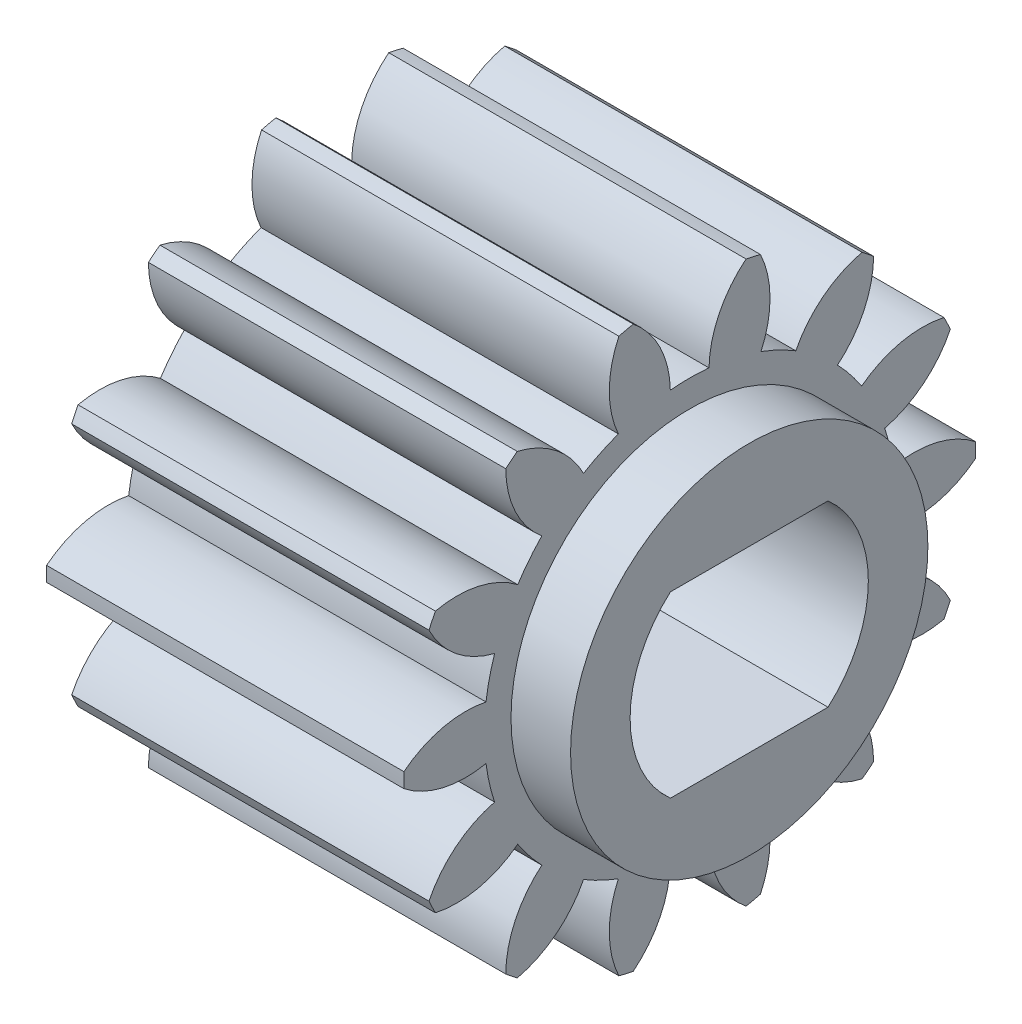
ISO-10303-21;
HEADER;
FILE_DESCRIPTION(('STEP AP214'),'2;1');
FILE_NAME('part.step','',(''),(''),'','','');
FILE_SCHEMA(('AUTOMOTIVE_DESIGN { 1 0 10303 214 1 1 1 1 }'));
ENDSEC;
DATA;
#1=APPLICATION_CONTEXT('core data for automotive mechanical design processes');
#2=APPLICATION_PROTOCOL_DEFINITION('international standard','automotive_design',2000,#1);
#3=PRODUCT_CONTEXT('',#1,'mechanical');
#4=PRODUCT('Part','Part','',(#3));
#5=PRODUCT_RELATED_PRODUCT_CATEGORY('part','',(#4));
#6=PRODUCT_DEFINITION_FORMATION('','',#4);
#7=PRODUCT_DEFINITION_CONTEXT('part definition',#1,'design');
#8=PRODUCT_DEFINITION('design','',#6,#7);
#9=PRODUCT_DEFINITION_SHAPE('','',#8);
#10=(LENGTH_UNIT() NAMED_UNIT(*) SI_UNIT(.MILLI.,.METRE.));
#11=(NAMED_UNIT(*) PLANE_ANGLE_UNIT() SI_UNIT($,.RADIAN.));
#12=(NAMED_UNIT(*) SI_UNIT($,.STERADIAN.) SOLID_ANGLE_UNIT());
#13=UNCERTAINTY_MEASURE_WITH_UNIT(LENGTH_MEASURE(1.E-05),#10,'distance_accuracy_value','');
#14=(GEOMETRIC_REPRESENTATION_CONTEXT(3) GLOBAL_UNCERTAINTY_ASSIGNED_CONTEXT((#13)) GLOBAL_UNIT_ASSIGNED_CONTEXT((#10,
#11,#12)) REPRESENTATION_CONTEXT('',''));
#15=CARTESIAN_POINT('',(0.,0.,0.));
#16=DIRECTION('',(0.,0.,1.));
#17=DIRECTION('',(1.,0.,0.));
#18=AXIS2_PLACEMENT_3D('',#15,#16,#17);
#19=CARTESIAN_POINT('',(0.,0.,0.));
#20=DIRECTION('',(1.,0.,0.));
#21=DIRECTION('',(0.,0.,-1.));
#22=AXIS2_PLACEMENT_3D('',#19,#20,#21);
#23=PLANE('',#22);
#24=CARTESIAN_POINT('',(0.,2.19368616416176,-3.28089210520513));
#25=DIRECTION('',(-1.,0.,0.));
#26=DIRECTION('',(0.,-0.433883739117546,-0.900968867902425));
#27=AXIS2_PLACEMENT_3D('',#24,#25,#26);
#28=CIRCLE('',#27,1.68);
#29=CARTESIAN_POINT('',(0.,2.95285412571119,-1.78220467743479));
#30=VERTEX_POINT('',#29);
#31=CARTESIAN_POINT('',(0.,3.8287515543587,-2.89493722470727));
#32=VERTEX_POINT('',#31);
#33=EDGE_CURVE('E785',#30,#32,#28,.T.);
#34=ORIENTED_EDGE('',*,*,#33,.T.);
#35=CARTESIAN_POINT('',(0.,0.,0.));
#36=DIRECTION('',(-1.,0.,0.));
#37=DIRECTION('',(0.,0.,1.));
#38=AXIS2_PLACEMENT_3D('',#35,#36,#37);
#39=CIRCLE('',#38,4.8);
#40=CARTESIAN_POINT('',(0.,3.67433247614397,-3.08857262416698));
#41=VERTEX_POINT('',#40);
#42=EDGE_CURVE('E479',#32,#41,#39,.T.);
#43=ORIENTED_EDGE('',*,*,#42,.T.);
#44=CARTESIAN_POINT('',(0.,3.68677438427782,-1.40861869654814));
#45=DIRECTION('',(1.,0.,0.));
#46=DIRECTION('',(0.,0.,-1.));
#47=AXIS2_PLACEMENT_3D('',#44,#45,#46);
#48=CIRCLE('',#47,1.68);
#49=CARTESIAN_POINT('',(0.,2.39459294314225,-2.48224205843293));
#50=VERTEX_POINT('',#49);
#51=EDGE_CURVE('E432',#50,#41,#48,.T.);
#52=ORIENTED_EDGE('',*,*,#51,.F.);
#53=CARTESIAN_POINT('',(0.,0.,0.));
#54=DIRECTION('',(-1.,0.,0.));
#55=DIRECTION('',(0.,-0.781831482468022,-0.623489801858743));
#56=AXIS2_PLACEMENT_3D('',#53,#54,#55);
#57=CIRCLE('',#56,3.449);
#58=CARTESIAN_POINT('',(0.,1.88716000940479,-2.88690631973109));
#59=VERTEX_POINT('',#58);
#60=EDGE_CURVE('E761',#50,#59,#57,.T.);
#61=ORIENTED_EDGE('',*,*,#60,.T.);
#62=CARTESIAN_POINT('',(0.,0.552917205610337,-3.9077864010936));
#63=DIRECTION('',(-1.,0.,0.));
#64=DIRECTION('',(0.,-0.781831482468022,-0.623489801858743));
#65=AXIS2_PLACEMENT_3D('',#62,#63,#64);
#66=CIRCLE('',#65,1.68);
#67=CARTESIAN_POINT('',(0.,2.19351976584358,-4.2694813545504));
#68=VERTEX_POINT('',#67);
#69=EDGE_CURVE('E764',#59,#68,#66,.T.);
#70=ORIENTED_EDGE('',*,*,#69,.T.);
#71=CARTESIAN_POINT('',(0.,1.97037773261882,-4.37694089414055));
#72=VERTEX_POINT('',#71);
#73=EDGE_CURVE('E945',#68,#72,#39,.T.);
#74=ORIENTED_EDGE('',*,*,#73,.T.);
#75=CARTESIAN_POINT('',(0.,2.71049219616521,-2.86875304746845));
#76=DIRECTION('',(1.,0.,0.));
#77=DIRECTION('',(0.,0.,-1.));
#78=AXIS2_PLACEMENT_3D('',#75,#76,#77);
#79=CIRCLE('',#78,1.68);
#80=CARTESIAN_POINT('',(0.,1.08044922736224,-3.27539775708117));
#81=VERTEX_POINT('',#80);
#82=EDGE_CURVE('E435',#81,#72,#79,.T.);
#83=ORIENTED_EDGE('',*,*,#82,.F.);
#84=CARTESIAN_POINT('',(0.,0.,0.));
#85=DIRECTION('',(-1.,0.,0.));
#86=DIRECTION('',(0.,-0.974927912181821,-0.222520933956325));
#87=AXIS2_PLACEMENT_3D('',#84,#85,#86);
#88=CIRCLE('',#87,3.449);
#89=CARTESIAN_POINT('',(0.,0.447690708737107,-3.41982075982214));
#90=VERTEX_POINT('',#89);
#91=EDGE_CURVE('E739',#81,#90,#88,.T.);
#92=ORIENTED_EDGE('',*,*,#91,.T.);
#93=CARTESIAN_POINT('',(0.,-1.19736378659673,-3.76069567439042));
#94=DIRECTION('',(-1.,0.,0.));
#95=DIRECTION('',(0.,-0.974927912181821,-0.222520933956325));
#96=AXIS2_PLACEMENT_3D('',#93,#94,#95);
#97=CIRCLE('',#96,1.68);
#98=CARTESIAN_POINT('',(0.,0.123834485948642,-4.79840234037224));
#99=VERTEX_POINT('',#98);
#100=EDGE_CURVE('E742',#90,#99,#97,.T.);
#101=ORIENTED_EDGE('',*,*,#100,.T.);
#102=CARTESIAN_POINT('',(0.,-0.123834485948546,-4.79840234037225));
#103=VERTEX_POINT('',#102);
#104=EDGE_CURVE('E956',#99,#103,#39,.T.);
#105=ORIENTED_EDGE('',*,*,#104,.T.);
#106=CARTESIAN_POINT('',(0.,1.19736378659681,-3.76069567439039));
#107=DIRECTION('',(1.,0.,0.));
#108=DIRECTION('',(0.,0.,-1.));
#109=AXIS2_PLACEMENT_3D('',#106,#107,#108);
#110=CIRCLE('',#109,1.68);
#111=CARTESIAN_POINT('',(0.,-0.447690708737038,-3.41982075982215));
#112=VERTEX_POINT('',#111);
#113=EDGE_CURVE('E438',#112,#103,#110,.T.);
#114=ORIENTED_EDGE('',*,*,#113,.F.);
#115=CARTESIAN_POINT('',(0.,0.,0.));
#116=DIRECTION('',(-1.,0.,0.));
#117=DIRECTION('',(0.,-0.974927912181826,0.222520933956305));
#118=AXIS2_PLACEMENT_3D('',#115,#116,#117);
#119=CIRCLE('',#118,3.449);
#120=CARTESIAN_POINT('',(0.,-1.08044922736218,-3.27539775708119));
#121=VERTEX_POINT('',#120);
#122=EDGE_CURVE('E717',#112,#121,#119,.T.);
#123=ORIENTED_EDGE('',*,*,#122,.T.);
#124=CARTESIAN_POINT('',(0.,-2.71049219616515,-2.86875304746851));
#125=DIRECTION('',(-1.,0.,0.));
#126=DIRECTION('',(0.,-0.974927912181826,0.222520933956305));
#127=AXIS2_PLACEMENT_3D('',#124,#125,#126);
#128=CIRCLE('',#127,1.68);
#129=CARTESIAN_POINT('',(0.,-1.97037773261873,-4.37694089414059));
#130=VERTEX_POINT('',#129);
#131=EDGE_CURVE('E720',#121,#130,#128,.T.);
#132=ORIENTED_EDGE('',*,*,#131,.T.);
#133=CARTESIAN_POINT('',(0.,-2.1935197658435,-4.26948135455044));
#134=VERTEX_POINT('',#133);
#135=EDGE_CURVE('E957',#130,#134,#39,.T.);
#136=ORIENTED_EDGE('',*,*,#135,.T.);
#137=CARTESIAN_POINT('',(0.,-0.552917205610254,-3.90778640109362));
#138=DIRECTION('',(1.,0.,0.));
#139=DIRECTION('',(0.,0.,-1.));
#140=AXIS2_PLACEMENT_3D('',#137,#138,#139);
#141=CIRCLE('',#140,1.68);
#142=CARTESIAN_POINT('',(0.,-1.88716000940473,-2.88690631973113));
#143=VERTEX_POINT('',#142);
#144=EDGE_CURVE('E441',#143,#134,#141,.T.);
#145=ORIENTED_EDGE('',*,*,#144,.F.);
#146=CARTESIAN_POINT('',(0.,0.,0.));
#147=DIRECTION('',(-1.,0.,0.));
#148=DIRECTION('',(0.,-0.781831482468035,0.623489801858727));
#149=AXIS2_PLACEMENT_3D('',#146,#147,#148);
#150=CIRCLE('',#149,3.449);
#151=CARTESIAN_POINT('',(0.,-2.3945929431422,-2.48224205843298));
#152=VERTEX_POINT('',#151);
#153=EDGE_CURVE('E695',#143,#152,#150,.T.);
#154=ORIENTED_EDGE('',*,*,#153,.T.);
#155=CARTESIAN_POINT('',(0.,-3.68677438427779,-1.40861869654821));
#156=DIRECTION('',(-1.,0.,0.));
#157=DIRECTION('',(0.,-0.781831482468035,0.623489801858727));
#158=AXIS2_PLACEMENT_3D('',#155,#156,#157);
#159=CIRCLE('',#158,1.68);
#160=CARTESIAN_POINT('',(0.,-3.6743324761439,-3.08857262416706));
#161=VERTEX_POINT('',#160);
#162=EDGE_CURVE('E698',#152,#161,#159,.T.);
#163=ORIENTED_EDGE('',*,*,#162,.T.);
#164=CARTESIAN_POINT('',(0.,-3.82875155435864,-2.89493722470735));
#165=VERTEX_POINT('',#164);
#166=EDGE_CURVE('E960',#161,#165,#39,.T.);
#167=ORIENTED_EDGE('',*,*,#166,.T.);
#168=CARTESIAN_POINT('',(0.,-2.19368616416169,-3.28089210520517));
#169=DIRECTION('',(1.,0.,0.));
#170=DIRECTION('',(0.,0.,-1.));
#171=AXIS2_PLACEMENT_3D('',#168,#169,#170);
#172=CIRCLE('',#171,1.68);
#173=CARTESIAN_POINT('',(0.,-2.95285412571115,-1.78220467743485));
#174=VERTEX_POINT('',#173);
#175=EDGE_CURVE('E444',#174,#165,#172,.T.);
#176=ORIENTED_EDGE('',*,*,#175,.F.);
#177=CARTESIAN_POINT('',(0.,0.,0.));
#178=DIRECTION('',(-1.,0.,0.));
#179=DIRECTION('',(0.,-0.433883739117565,0.900968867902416));
#180=AXIS2_PLACEMENT_3D('',#177,#178,#179);
#181=CIRCLE('',#180,3.449);
#182=CARTESIAN_POINT('',(0.,-3.23445815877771,-1.19744787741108));
#183=VERTEX_POINT('',#182);
#184=EDGE_CURVE('E673',#174,#183,#181,.T.);
#185=ORIENTED_EDGE('',*,*,#184,.T.);
#186=CARTESIAN_POINT('',(0.,-3.93284569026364,0.330509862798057));
#187=DIRECTION('',(-1.,0.,0.));
#188=DIRECTION('',(0.,-0.433883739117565,0.900968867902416));
#189=AXIS2_PLACEMENT_3D('',#186,#187,#188);
#190=CIRCLE('',#189,1.68);
#191=CARTESIAN_POINT('',(0.,-4.6505406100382,-1.1884746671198));
#192=VERTEX_POINT('',#191);
#193=EDGE_CURVE('E676',#183,#192,#190,.T.);
#194=ORIENTED_EDGE('',*,*,#193,.T.);
#195=CARTESIAN_POINT('',(0.,-4.70565214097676,-0.947015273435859));
#196=VERTEX_POINT('',#195);
#197=EDGE_CURVE('E963',#192,#196,#39,.T.);
#198=ORIENTED_EDGE('',*,*,#197,.T.);
#199=CARTESIAN_POINT('',(0.,-3.39996867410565,-2.00417689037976));
#200=DIRECTION('',(1.,0.,0.));
#201=DIRECTION('',(0.,0.,-1.));
#202=AXIS2_PLACEMENT_3D('',#199,#200,#201);
#203=CIRCLE('',#202,1.68);
#204=CARTESIAN_POINT('',(0.,-3.43369926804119,-0.324515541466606));
#205=VERTEX_POINT('',#204);
#206=EDGE_CURVE('E447',#205,#196,#203,.T.);
#207=ORIENTED_EDGE('',*,*,#206,.F.);
#208=CARTESIAN_POINT('',(0.,0.,0.));
#209=DIRECTION('',(-1.,0.,0.));
#210=DIRECTION('',(0.,0.,1.));
#211=AXIS2_PLACEMENT_3D('',#208,#209,#210);
#212=CIRCLE('',#211,3.449);
#213=CARTESIAN_POINT('',(0.,-3.4336992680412,0.324515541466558));
#214=VERTEX_POINT('',#213);
#215=EDGE_CURVE('E651',#205,#214,#212,.T.);
#216=ORIENTED_EDGE('',*,*,#215,.T.);
#217=CARTESIAN_POINT('',(0.,-3.39996867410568,2.00417689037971));
#218=DIRECTION('',(-1.,0.,0.));
#219=DIRECTION('',(0.,0.,1.));
#220=AXIS2_PLACEMENT_3D('',#217,#218,#219);
#221=CIRCLE('',#220,1.68);
#222=CARTESIAN_POINT('',(0.,-4.70565214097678,0.947015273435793));
#223=VERTEX_POINT('',#222);
#224=EDGE_CURVE('E654',#214,#223,#221,.T.);
#225=ORIENTED_EDGE('',*,*,#224,.T.);
#226=CARTESIAN_POINT('',(0.,-4.65054061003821,1.18847466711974));
#227=VERTEX_POINT('',#226);
#228=EDGE_CURVE('E966',#223,#227,#39,.T.);
#229=ORIENTED_EDGE('',*,*,#228,.T.);
#230=CARTESIAN_POINT('',(0.,-3.93284569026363,-0.330509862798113));
#231=DIRECTION('',(1.,0.,0.));
#232=DIRECTION('',(0.,0.,-1.));
#233=AXIS2_PLACEMENT_3D('',#230,#231,#232);
#234=CIRCLE('',#233,1.68);
#235=CARTESIAN_POINT('',(0.,-3.23445815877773,1.19744787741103));
#236=VERTEX_POINT('',#235);
#237=EDGE_CURVE('E450',#236,#227,#234,.T.);
#238=ORIENTED_EDGE('',*,*,#237,.F.);
#239=CARTESIAN_POINT('',(0.,0.,0.));
#240=DIRECTION('',(-1.,0.,0.));
#241=DIRECTION('',(0.,0.433883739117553,0.900968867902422));
#242=AXIS2_PLACEMENT_3D('',#239,#240,#241);
#243=CIRCLE('',#242,3.449);
#244=CARTESIAN_POINT('',(0.,-2.95285412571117,1.78220467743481));
#245=VERTEX_POINT('',#244);
#246=EDGE_CURVE('E629',#236,#245,#243,.T.);
#247=ORIENTED_EDGE('',*,*,#246,.T.);
#248=CARTESIAN_POINT('',(0.,-2.19368616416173,3.28089210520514));
#249=DIRECTION('',(-1.,0.,0.));
#250=DIRECTION('',(0.,0.433883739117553,0.900968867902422));
#251=AXIS2_PLACEMENT_3D('',#248,#249,#250);
#252=CIRCLE('',#251,1.68);
#253=CARTESIAN_POINT('',(0.,-3.82875155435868,2.8949372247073));
#254=VERTEX_POINT('',#253);
#255=EDGE_CURVE('E632',#245,#254,#252,.T.);
#256=ORIENTED_EDGE('',*,*,#255,.T.);
#257=CARTESIAN_POINT('',(0.,-3.67433247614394,3.08857262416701));
#258=VERTEX_POINT('',#257);
#259=EDGE_CURVE('E969',#254,#258,#39,.T.);
#260=ORIENTED_EDGE('',*,*,#259,.T.);
#261=CARTESIAN_POINT('',(0.,-3.68677438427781,1.40861869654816));
#262=DIRECTION('',(1.,0.,0.));
#263=DIRECTION('',(0.,0.,-1.));
#264=AXIS2_PLACEMENT_3D('',#261,#262,#263);
#265=CIRCLE('',#264,1.68);
#266=CARTESIAN_POINT('',(0.,-2.39459294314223,2.48224205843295));
#267=VERTEX_POINT('',#266);
#268=EDGE_CURVE('E453',#267,#258,#265,.T.);
#269=ORIENTED_EDGE('',*,*,#268,.F.);
#270=CARTESIAN_POINT('',(0.,0.,0.));
#271=DIRECTION('',(-1.,0.,0.));
#272=DIRECTION('',(0.,0.781831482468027,0.623489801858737));
#273=AXIS2_PLACEMENT_3D('',#270,#271,#272);
#274=CIRCLE('',#273,3.449);
#275=CARTESIAN_POINT('',(0.,-1.88716000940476,2.88690631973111));
#276=VERTEX_POINT('',#275);
#277=EDGE_CURVE('E607',#267,#276,#274,.T.);
#278=ORIENTED_EDGE('',*,*,#277,.T.);
#279=CARTESIAN_POINT('',(0.,-0.552917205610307,3.90778640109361));
#280=DIRECTION('',(-1.,0.,0.));
#281=DIRECTION('',(0.,0.781831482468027,0.623489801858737));
#282=AXIS2_PLACEMENT_3D('',#279,#280,#281);
#283=CIRCLE('',#282,1.68);
#284=CARTESIAN_POINT('',(0.,-2.19351976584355,4.26948135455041));
#285=VERTEX_POINT('',#284);
#286=EDGE_CURVE('E610',#276,#285,#283,.T.);
#287=ORIENTED_EDGE('',*,*,#286,.T.);
#288=CARTESIAN_POINT('',(0.,-1.97037773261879,4.37694089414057));
#289=VERTEX_POINT('',#288);
#290=EDGE_CURVE('E972',#285,#289,#39,.T.);
#291=ORIENTED_EDGE('',*,*,#290,.T.);
#292=CARTESIAN_POINT('',(0.,-2.71049219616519,2.86875304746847));
#293=DIRECTION('',(1.,0.,0.));
#294=DIRECTION('',(0.,0.,-1.));
#295=AXIS2_PLACEMENT_3D('',#292,#293,#294);
#296=CIRCLE('',#295,1.68);
#297=CARTESIAN_POINT('',(0.,-1.08044922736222,3.27539775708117));
#298=VERTEX_POINT('',#297);
#299=EDGE_CURVE('E456',#298,#289,#296,.T.);
#300=ORIENTED_EDGE('',*,*,#299,.F.);
#301=CARTESIAN_POINT('',(0.,0.,0.));
#302=DIRECTION('',(-1.,0.,0.));
#303=DIRECTION('',(0.,0.974927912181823,0.222520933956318));
#304=AXIS2_PLACEMENT_3D('',#301,#302,#303);
#305=CIRCLE('',#304,3.449);
#306=CARTESIAN_POINT('',(0.,-0.447690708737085,3.41982075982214));
#307=VERTEX_POINT('',#306);
#308=EDGE_CURVE('E585',#298,#307,#305,.T.);
#309=ORIENTED_EDGE('',*,*,#308,.T.);
#310=CARTESIAN_POINT('',(0.,1.19736378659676,3.76069567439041));
#311=DIRECTION('',(-1.,0.,0.));
#312=DIRECTION('',(0.,0.974927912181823,0.222520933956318));
#313=AXIS2_PLACEMENT_3D('',#310,#311,#312);
#314=CIRCLE('',#313,1.68);
#315=CARTESIAN_POINT('',(0.,-0.12383448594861,4.79840234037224));
#316=VERTEX_POINT('',#315);
#317=EDGE_CURVE('E588',#307,#316,#314,.T.);
#318=ORIENTED_EDGE('',*,*,#317,.T.);
#319=CARTESIAN_POINT('',(0.,0.123834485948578,4.79840234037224));
#320=VERTEX_POINT('',#319);
#321=EDGE_CURVE('E975',#316,#320,#39,.T.);
#322=ORIENTED_EDGE('',*,*,#321,.T.);
#323=CARTESIAN_POINT('',(0.,-1.19736378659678,3.7606956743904));
#324=DIRECTION('',(1.,0.,0.));
#325=DIRECTION('',(0.,0.,-1.));
#326=AXIS2_PLACEMENT_3D('',#323,#324,#325);
#327=CIRCLE('',#326,1.68);
#328=CARTESIAN_POINT('',(0.,0.447690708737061,3.41982075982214));
#329=VERTEX_POINT('',#328);
#330=EDGE_CURVE('E459',#329,#320,#327,.T.);
#331=ORIENTED_EDGE('',*,*,#330,.F.);
#332=CARTESIAN_POINT('',(0.,0.,0.));
#333=DIRECTION('',(-1.,0.,0.));
#334=DIRECTION('',(0.,0.974927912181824,-0.222520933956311));
#335=AXIS2_PLACEMENT_3D('',#332,#333,#334);
#336=CIRCLE('',#335,3.449);
#337=CARTESIAN_POINT('',(0.,1.0804492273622,3.27539775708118));
#338=VERTEX_POINT('',#337);
#339=EDGE_CURVE('E563',#329,#338,#336,.T.);
#340=ORIENTED_EDGE('',*,*,#339,.T.);
#341=CARTESIAN_POINT('',(0.,2.71049219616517,2.86875304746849));
#342=DIRECTION('',(-1.,0.,0.));
#343=DIRECTION('',(0.,0.974927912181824,-0.222520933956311));
#344=AXIS2_PLACEMENT_3D('',#341,#342,#343);
#345=CIRCLE('',#344,1.68);
#346=CARTESIAN_POINT('',(0.,1.97037773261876,4.37694089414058));
#347=VERTEX_POINT('',#346);
#348=EDGE_CURVE('E566',#338,#347,#345,.T.);
#349=ORIENTED_EDGE('',*,*,#348,.T.);
#350=CARTESIAN_POINT('',(0.,2.19351976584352,4.26948135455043));
#351=VERTEX_POINT('',#350);
#352=EDGE_CURVE('E978',#347,#351,#39,.T.);
#353=ORIENTED_EDGE('',*,*,#352,.T.);
#354=CARTESIAN_POINT('',(0.,0.552917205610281,3.90778640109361));
#355=DIRECTION('',(1.,0.,0.));
#356=DIRECTION('',(0.,0.,-1.));
#357=AXIS2_PLACEMENT_3D('',#354,#355,#356);
#358=CIRCLE('',#357,1.68);
#359=CARTESIAN_POINT('',(0.,1.88716000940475,2.88690631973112));
#360=VERTEX_POINT('',#359);
#361=EDGE_CURVE('E462',#360,#351,#358,.T.);
#362=ORIENTED_EDGE('',*,*,#361,.F.);
#363=CARTESIAN_POINT('',(0.,0.,0.));
#364=DIRECTION('',(-1.,0.,0.));
#365=DIRECTION('',(0.,0.781831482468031,-0.623489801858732));
#366=AXIS2_PLACEMENT_3D('',#363,#364,#365);
#367=CIRCLE('',#366,3.449);
#368=CARTESIAN_POINT('',(0.,2.39459294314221,2.48224205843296));
#369=VERTEX_POINT('',#368);
#370=EDGE_CURVE('E541',#360,#369,#367,.T.);
#371=ORIENTED_EDGE('',*,*,#370,.T.);
#372=CARTESIAN_POINT('',(0.,3.6867743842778,1.40861869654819));
#373=DIRECTION('',(-1.,0.,0.));
#374=DIRECTION('',(0.,0.781831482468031,-0.623489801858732));
#375=AXIS2_PLACEMENT_3D('',#372,#373,#374);
#376=CIRCLE('',#375,1.68);
#377=CARTESIAN_POINT('',(0.,3.67433247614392,3.08857262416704));
#378=VERTEX_POINT('',#377);
#379=EDGE_CURVE('E544',#369,#378,#376,.T.);
#380=ORIENTED_EDGE('',*,*,#379,.T.);
#381=CARTESIAN_POINT('',(0.,3.82875155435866,2.89493722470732));
#382=VERTEX_POINT('',#381);
#383=EDGE_CURVE('E981',#378,#382,#39,.T.);
#384=ORIENTED_EDGE('',*,*,#383,.T.);
#385=CARTESIAN_POINT('',(0.,2.19368616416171,3.28089210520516));
#386=DIRECTION('',(1.,0.,0.));
#387=DIRECTION('',(0.,0.,-1.));
#388=AXIS2_PLACEMENT_3D('',#385,#386,#387);
#389=CIRCLE('',#388,1.68);
#390=CARTESIAN_POINT('',(0.,2.95285412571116,1.78220467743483));
#391=VERTEX_POINT('',#390);
#392=EDGE_CURVE('E465',#391,#382,#389,.T.);
#393=ORIENTED_EDGE('',*,*,#392,.F.);
#394=CARTESIAN_POINT('',(0.,0.,0.));
#395=DIRECTION('',(-1.,0.,0.));
#396=DIRECTION('',(0.,0.433883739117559,-0.900968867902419));
#397=AXIS2_PLACEMENT_3D('',#394,#395,#396);
#398=CIRCLE('',#397,3.449);
#399=CARTESIAN_POINT('',(0.,3.23445815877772,1.19744787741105));
#400=VERTEX_POINT('',#399);
#401=EDGE_CURVE('E519',#391,#400,#398,.T.);
#402=ORIENTED_EDGE('',*,*,#401,.T.);
#403=CARTESIAN_POINT('',(0.,3.93284569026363,-0.330509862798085));
#404=DIRECTION('',(-1.,0.,0.));
#405=DIRECTION('',(0.,0.433883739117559,-0.900968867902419));
#406=AXIS2_PLACEMENT_3D('',#403,#404,#405);
#407=CIRCLE('',#406,1.68);
#408=CARTESIAN_POINT('',(0.,4.65054061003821,1.18847466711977));
#409=VERTEX_POINT('',#408);
#410=EDGE_CURVE('E522',#400,#409,#407,.T.);
#411=ORIENTED_EDGE('',*,*,#410,.T.);
#412=CARTESIAN_POINT('',(0.,4.70565214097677,0.947015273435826));
#413=VERTEX_POINT('',#412);
#414=EDGE_CURVE('E480',#409,#413,#39,.T.);
#415=ORIENTED_EDGE('',*,*,#414,.T.);
#416=CARTESIAN_POINT('',(0.,3.39996867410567,2.00417689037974));
#417=DIRECTION('',(1.,0.,0.));
#418=DIRECTION('',(0.,0.,-1.));
#419=AXIS2_PLACEMENT_3D('',#416,#417,#418);
#420=CIRCLE('',#419,1.68);
#421=CARTESIAN_POINT('',(0.,3.4336992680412,0.324515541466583));
#422=VERTEX_POINT('',#421);
#423=EDGE_CURVE('E468',#422,#413,#420,.T.);
#424=ORIENTED_EDGE('',*,*,#423,.F.);
#425=CARTESIAN_POINT('',(0.,0.,0.));
#426=DIRECTION('',(-1.,0.,0.));
#427=DIRECTION('',(0.,0.,-1.));
#428=AXIS2_PLACEMENT_3D('',#425,#426,#427);
#429=CIRCLE('',#428,3.449);
#430=CARTESIAN_POINT('',(0.,3.4336992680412,-0.324515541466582));
#431=VERTEX_POINT('',#430);
#432=EDGE_CURVE('E497',#422,#431,#429,.T.);
#433=ORIENTED_EDGE('',*,*,#432,.T.);
#434=CARTESIAN_POINT('',(0.,3.39996867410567,-2.00417689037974));
#435=DIRECTION('',(-1.,0.,0.));
#436=DIRECTION('',(0.,0.,-1.));
#437=AXIS2_PLACEMENT_3D('',#434,#435,#436);
#438=CIRCLE('',#437,1.68);
#439=CARTESIAN_POINT('',(0.,4.70565214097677,-0.947015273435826));
#440=VERTEX_POINT('',#439);
#441=EDGE_CURVE('E500',#431,#440,#438,.T.);
#442=ORIENTED_EDGE('',*,*,#441,.T.);
#443=CARTESIAN_POINT('',(0.,4.65054061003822,-1.18847466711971));
#444=VERTEX_POINT('',#443);
#445=EDGE_CURVE('E476',#440,#444,#39,.T.);
#446=ORIENTED_EDGE('',*,*,#445,.T.);
#447=CARTESIAN_POINT('',(0.,3.93284569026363,0.33050986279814));
#448=DIRECTION('',(1.,0.,0.));
#449=DIRECTION('',(0.,0.,-1.));
#450=AXIS2_PLACEMENT_3D('',#447,#448,#449);
#451=CIRCLE('',#450,1.68);
#452=CARTESIAN_POINT('',(0.,3.23445815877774,-1.19744787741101));
#453=VERTEX_POINT('',#452);
#454=EDGE_CURVE('E430',#453,#444,#451,.T.);
#455=ORIENTED_EDGE('',*,*,#454,.F.);
#456=CARTESIAN_POINT('',(0.,0.,0.));
#457=DIRECTION('',(-1.,0.,0.));
#458=DIRECTION('',(0.,-0.433883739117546,-0.900968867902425));
#459=AXIS2_PLACEMENT_3D('',#456,#457,#458);
#460=CIRCLE('',#459,3.449);
#461=EDGE_CURVE('E782',#453,#30,#460,.T.);
#462=ORIENTED_EDGE('',*,*,#461,.T.);
#463=EDGE_LOOP('',(#34,#43,#52,#61,#70,#74,#83,#92,#101,#105,#114,#123,#132,#136,#145,#154,#163,
#167,#176,#185,#194,#198,#207,#216,#225,#229,#238,#247,#256,#260,#269,#278,#287,#291,#300,#309,
#318,#322,#331,#340,#349,#353,#362,#371,#380,#384,#393,#402,#411,#415,#424,#433,#442,#446,#455,#462));
#464=FACE_BOUND('',#463,.T.);
#465=CARTESIAN_POINT('',(0.,0.,0.));
#466=DIRECTION('',(1.,0.,0.));
#467=DIRECTION('',(0.,0.,-1.));
#468=AXIS2_PLACEMENT_3D('',#465,#466,#467);
#469=CIRCLE('',#468,2.);
#470=CARTESIAN_POINT('',(0.,-1.5,1.3228756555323));
#471=VERTEX_POINT('',#470);
#472=CARTESIAN_POINT('',(0.,1.5,1.3228756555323));
#473=VERTEX_POINT('',#472);
#474=EDGE_CURVE('E418',#471,#473,#469,.F.);
#475=ORIENTED_EDGE('',*,*,#474,.F.);
#476=DIRECTION('',(0.,0.,1.));
#477=VECTOR('',#476,1.);
#478=CARTESIAN_POINT('',(0.,-1.5,0.));
#479=LINE('',#478,#477);
#480=CARTESIAN_POINT('',(0.,-1.5,-1.3228756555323));
#481=VERTEX_POINT('',#480);
#482=EDGE_CURVE('E792',#481,#471,#479,.T.);
#483=ORIENTED_EDGE('',*,*,#482,.F.);
#484=CARTESIAN_POINT('',(0.,0.,0.));
#485=DIRECTION('',(1.,0.,0.));
#486=DIRECTION('',(0.,0.,-1.));
#487=AXIS2_PLACEMENT_3D('',#484,#485,#486);
#488=CIRCLE('',#487,2.);
#489=CARTESIAN_POINT('',(0.,1.5,-1.32287565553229));
#490=VERTEX_POINT('',#489);
#491=EDGE_CURVE('E794',#490,#481,#488,.F.);
#492=ORIENTED_EDGE('',*,*,#491,.F.);
#493=DIRECTION('',(0.,0.,-1.));
#494=VECTOR('',#493,1.);
#495=CARTESIAN_POINT('',(0.,1.5,0.));
#496=LINE('',#495,#494);
#497=EDGE_CURVE('E796',#473,#490,#496,.T.);
#498=ORIENTED_EDGE('',*,*,#497,.F.);
#499=EDGE_LOOP('',(#475,#483,#492,#498));
#500=FACE_BOUND('',#499,.T.);
#501=ADVANCED_FACE('F32',(#464,#500),#23,.F.);
#502=CARTESIAN_POINT('',(7.,0.,0.));
#503=DIRECTION('',(1.,0.,0.));
#504=DIRECTION('',(0.,0.,-1.));
#505=AXIS2_PLACEMENT_3D('',#502,#503,#504);
#506=PLANE('',#505);
#507=CARTESIAN_POINT('',(7.,0.,0.));
#508=DIRECTION('',(1.,0.,0.));
#509=DIRECTION('',(0.,0.,-1.));
#510=AXIS2_PLACEMENT_3D('',#507,#508,#509);
#511=CIRCLE('',#510,3.);
#512=CARTESIAN_POINT('',(7.,0.,-3.));
#513=VERTEX_POINT('',#512);
#514=EDGE_CURVE('E788',#513,#513,#511,.T.);
#515=ORIENTED_EDGE('',*,*,#514,.T.);
#516=EDGE_LOOP('',(#515));
#517=FACE_BOUND('',#516,.T.);
#518=DIRECTION('',(0.,0.,1.));
#519=VECTOR('',#518,1.);
#520=CARTESIAN_POINT('',(7.,-1.5,0.));
#521=LINE('',#520,#519);
#522=CARTESIAN_POINT('',(7.,-1.5,-1.3228756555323));
#523=VERTEX_POINT('',#522);
#524=CARTESIAN_POINT('',(7.,-1.5,1.3228756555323));
#525=VERTEX_POINT('',#524);
#526=EDGE_CURVE('E40',#523,#525,#521,.T.);
#527=ORIENTED_EDGE('',*,*,#526,.T.);
#528=CARTESIAN_POINT('',(7.,0.,0.));
#529=DIRECTION('',(1.,0.,0.));
#530=DIRECTION('',(0.,0.,-1.));
#531=AXIS2_PLACEMENT_3D('',#528,#529,#530);
#532=CIRCLE('',#531,2.);
#533=CARTESIAN_POINT('',(7.,1.5,1.3228756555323));
#534=VERTEX_POINT('',#533);
#535=EDGE_CURVE('E11',#525,#534,#532,.F.);
#536=ORIENTED_EDGE('',*,*,#535,.T.);
#537=DIRECTION('',(0.,0.,-1.));
#538=VECTOR('',#537,1.);
#539=CARTESIAN_POINT('',(7.,1.5,0.));
#540=LINE('',#539,#538);
#541=CARTESIAN_POINT('',(7.,1.5,-1.32287565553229));
#542=VERTEX_POINT('',#541);
#543=EDGE_CURVE('E406',#534,#542,#540,.T.);
#544=ORIENTED_EDGE('',*,*,#543,.T.);
#545=CARTESIAN_POINT('',(7.,0.,0.));
#546=DIRECTION('',(1.,0.,0.));
#547=DIRECTION('',(0.,0.,-1.));
#548=AXIS2_PLACEMENT_3D('',#545,#546,#547);
#549=CIRCLE('',#548,2.);
#550=EDGE_CURVE('E410',#542,#523,#549,.F.);
#551=ORIENTED_EDGE('',*,*,#550,.T.);
#552=EDGE_LOOP('',(#527,#536,#544,#551));
#553=FACE_BOUND('',#552,.T.);
#554=ADVANCED_FACE('F422',(#517,#553),#506,.T.);
#555=CARTESIAN_POINT('',(6.,0.,0.));
#556=DIRECTION('',(-1.,0.,0.));
#557=DIRECTION('',(0.,0.,1.));
#558=AXIS2_PLACEMENT_3D('',#555,#556,#557);
#559=PLANE('',#558);
#560=CARTESIAN_POINT('',(6.,2.19368616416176,-3.28089210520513));
#561=DIRECTION('',(-1.,0.,0.));
#562=DIRECTION('',(0.,-0.433883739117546,-0.900968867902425));
#563=AXIS2_PLACEMENT_3D('',#560,#561,#562);
#564=CIRCLE('',#563,1.68);
#565=CARTESIAN_POINT('',(6.,2.95285412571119,-1.78220467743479));
#566=VERTEX_POINT('',#565);
#567=CARTESIAN_POINT('',(6.,3.8287515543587,-2.89493722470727));
#568=VERTEX_POINT('',#567);
#569=EDGE_CURVE('E780',#566,#568,#564,.T.);
#570=ORIENTED_EDGE('',*,*,#569,.F.);
#571=CARTESIAN_POINT('',(6.,0.,0.));
#572=DIRECTION('',(-1.,0.,0.));
#573=DIRECTION('',(0.,-0.433883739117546,-0.900968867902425));
#574=AXIS2_PLACEMENT_3D('',#571,#572,#573);
#575=CIRCLE('',#574,3.449);
#576=CARTESIAN_POINT('',(6.,3.23445815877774,-1.19744787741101));
#577=VERTEX_POINT('',#576);
#578=EDGE_CURVE('E776',#577,#566,#575,.T.);
#579=ORIENTED_EDGE('',*,*,#578,.F.);
#580=CARTESIAN_POINT('',(6.,3.93284569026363,0.33050986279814));
#581=DIRECTION('',(-1.,0.,0.));
#582=DIRECTION('',(0.,-0.433883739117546,-0.900968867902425));
#583=AXIS2_PLACEMENT_3D('',#580,#581,#582);
#584=CIRCLE('',#583,1.68);
#585=CARTESIAN_POINT('',(6.,4.65054061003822,-1.18847466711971));
#586=VERTEX_POINT('',#585);
#587=EDGE_CURVE('E778',#586,#577,#584,.T.);
#588=ORIENTED_EDGE('',*,*,#587,.F.);
#589=CARTESIAN_POINT('',(6.,0.,0.));
#590=DIRECTION('',(-1.,0.,0.));
#591=DIRECTION('',(0.,0.,1.));
#592=AXIS2_PLACEMENT_3D('',#589,#590,#591);
#593=CIRCLE('',#592,4.8);
#594=CARTESIAN_POINT('',(6.,4.70565214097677,-0.947015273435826));
#595=VERTEX_POINT('',#594);
#596=EDGE_CURVE('E471',#595,#586,#593,.T.);
#597=ORIENTED_EDGE('',*,*,#596,.F.);
#598=CARTESIAN_POINT('',(6.,3.39996867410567,-2.00417689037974));
#599=DIRECTION('',(-1.,0.,0.));
#600=DIRECTION('',(0.,0.,-1.));
#601=AXIS2_PLACEMENT_3D('',#598,#599,#600);
#602=CIRCLE('',#601,1.68);
#603=CARTESIAN_POINT('',(6.,3.4336992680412,-0.324515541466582));
#604=VERTEX_POINT('',#603);
#605=EDGE_CURVE('E495',#604,#595,#602,.T.);
#606=ORIENTED_EDGE('',*,*,#605,.F.);
#607=CARTESIAN_POINT('',(6.,0.,0.));
#608=DIRECTION('',(-1.,0.,0.));
#609=DIRECTION('',(0.,0.,-1.));
#610=AXIS2_PLACEMENT_3D('',#607,#608,#609);
#611=CIRCLE('',#610,3.449);
#612=CARTESIAN_POINT('',(6.,3.4336992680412,0.324515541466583));
#613=VERTEX_POINT('',#612);
#614=EDGE_CURVE('E491',#613,#604,#611,.T.);
#615=ORIENTED_EDGE('',*,*,#614,.F.);
#616=CARTESIAN_POINT('',(6.,3.39996867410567,2.00417689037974));
#617=DIRECTION('',(-1.,0.,0.));
#618=DIRECTION('',(0.,0.,-1.));
#619=AXIS2_PLACEMENT_3D('',#616,#617,#618);
#620=CIRCLE('',#619,1.68);
#621=CARTESIAN_POINT('',(6.,4.70565214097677,0.947015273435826));
#622=VERTEX_POINT('',#621);
#623=EDGE_CURVE('E493',#622,#613,#620,.T.);
#624=ORIENTED_EDGE('',*,*,#623,.F.);
#625=CARTESIAN_POINT('',(6.,4.65054061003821,1.18847466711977));
#626=VERTEX_POINT('',#625);
#627=EDGE_CURVE('E475',#626,#622,#593,.T.);
#628=ORIENTED_EDGE('',*,*,#627,.F.);
#629=CARTESIAN_POINT('',(6.,3.93284569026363,-0.330509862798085));
#630=DIRECTION('',(-1.,0.,0.));
#631=DIRECTION('',(0.,0.433883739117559,-0.900968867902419));
#632=AXIS2_PLACEMENT_3D('',#629,#630,#631);
#633=CIRCLE('',#632,1.68);
#634=CARTESIAN_POINT('',(6.,3.23445815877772,1.19744787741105));
#635=VERTEX_POINT('',#634);
#636=EDGE_CURVE('E517',#635,#626,#633,.T.);
#637=ORIENTED_EDGE('',*,*,#636,.F.);
#638=CARTESIAN_POINT('',(6.,0.,0.));
#639=DIRECTION('',(-1.,0.,0.));
#640=DIRECTION('',(0.,0.433883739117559,-0.900968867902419));
#641=AXIS2_PLACEMENT_3D('',#638,#639,#640);
#642=CIRCLE('',#641,3.449);
#643=CARTESIAN_POINT('',(6.,2.95285412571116,1.78220467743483));
#644=VERTEX_POINT('',#643);
#645=EDGE_CURVE('E513',#644,#635,#642,.T.);
#646=ORIENTED_EDGE('',*,*,#645,.F.);
#647=CARTESIAN_POINT('',(6.,2.19368616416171,3.28089210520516));
#648=DIRECTION('',(-1.,0.,0.));
#649=DIRECTION('',(0.,0.433883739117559,-0.900968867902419));
#650=AXIS2_PLACEMENT_3D('',#647,#648,#649);
#651=CIRCLE('',#650,1.68);
#652=CARTESIAN_POINT('',(6.,3.82875155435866,2.89493722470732));
#653=VERTEX_POINT('',#652);
#654=EDGE_CURVE('E515',#653,#644,#651,.T.);
#655=ORIENTED_EDGE('',*,*,#654,.F.);
#656=CARTESIAN_POINT('',(6.,3.67433247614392,3.08857262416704));
#657=VERTEX_POINT('',#656);
#658=EDGE_CURVE('E908',#657,#653,#593,.T.);
#659=ORIENTED_EDGE('',*,*,#658,.F.);
#660=CARTESIAN_POINT('',(6.,3.6867743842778,1.40861869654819));
#661=DIRECTION('',(-1.,0.,0.));
#662=DIRECTION('',(0.,0.781831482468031,-0.623489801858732));
#663=AXIS2_PLACEMENT_3D('',#660,#661,#662);
#664=CIRCLE('',#663,1.68);
#665=CARTESIAN_POINT('',(6.,2.39459294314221,2.48224205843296));
#666=VERTEX_POINT('',#665);
#667=EDGE_CURVE('E539',#666,#657,#664,.T.);
#668=ORIENTED_EDGE('',*,*,#667,.F.);
#669=CARTESIAN_POINT('',(6.,0.,0.));
#670=DIRECTION('',(-1.,0.,0.));
#671=DIRECTION('',(0.,0.781831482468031,-0.623489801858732));
#672=AXIS2_PLACEMENT_3D('',#669,#670,#671);
#673=CIRCLE('',#672,3.449);
#674=CARTESIAN_POINT('',(6.,1.88716000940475,2.88690631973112));
#675=VERTEX_POINT('',#674);
#676=EDGE_CURVE('E535',#675,#666,#673,.T.);
#677=ORIENTED_EDGE('',*,*,#676,.F.);
#678=CARTESIAN_POINT('',(6.,0.552917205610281,3.90778640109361));
#679=DIRECTION('',(-1.,0.,0.));
#680=DIRECTION('',(0.,0.781831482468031,-0.623489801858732));
#681=AXIS2_PLACEMENT_3D('',#678,#679,#680);
#682=CIRCLE('',#681,1.68);
#683=CARTESIAN_POINT('',(6.,2.19351976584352,4.26948135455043));
#684=VERTEX_POINT('',#683);
#685=EDGE_CURVE('E537',#684,#675,#682,.T.);
#686=ORIENTED_EDGE('',*,*,#685,.F.);
#687=CARTESIAN_POINT('',(6.,1.97037773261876,4.37694089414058));
#688=VERTEX_POINT('',#687);
#689=EDGE_CURVE('E903',#688,#684,#593,.T.);
#690=ORIENTED_EDGE('',*,*,#689,.F.);
#691=CARTESIAN_POINT('',(6.,2.71049219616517,2.86875304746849));
#692=DIRECTION('',(-1.,0.,0.));
#693=DIRECTION('',(0.,0.974927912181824,-0.222520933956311));
#694=AXIS2_PLACEMENT_3D('',#691,#692,#693);
#695=CIRCLE('',#694,1.68);
#696=CARTESIAN_POINT('',(6.,1.0804492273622,3.27539775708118));
#697=VERTEX_POINT('',#696);
#698=EDGE_CURVE('E561',#697,#688,#695,.T.);
#699=ORIENTED_EDGE('',*,*,#698,.F.);
#700=CARTESIAN_POINT('',(6.,0.,0.));
#701=DIRECTION('',(-1.,0.,0.));
#702=DIRECTION('',(0.,0.974927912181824,-0.222520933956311));
#703=AXIS2_PLACEMENT_3D('',#700,#701,#702);
#704=CIRCLE('',#703,3.449);
#705=CARTESIAN_POINT('',(6.,0.447690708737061,3.41982075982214));
#706=VERTEX_POINT('',#705);
#707=EDGE_CURVE('E557',#706,#697,#704,.T.);
#708=ORIENTED_EDGE('',*,*,#707,.F.);
#709=CARTESIAN_POINT('',(6.,-1.19736378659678,3.7606956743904));
#710=DIRECTION('',(-1.,0.,0.));
#711=DIRECTION('',(0.,0.974927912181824,-0.222520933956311));
#712=AXIS2_PLACEMENT_3D('',#709,#710,#711);
#713=CIRCLE('',#712,1.68);
#714=CARTESIAN_POINT('',(6.,0.123834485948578,4.79840234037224));
#715=VERTEX_POINT('',#714);
#716=EDGE_CURVE('E559',#715,#706,#713,.T.);
#717=ORIENTED_EDGE('',*,*,#716,.F.);
#718=CARTESIAN_POINT('',(6.,-0.12383448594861,4.79840234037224));
#719=VERTEX_POINT('',#718);
#720=EDGE_CURVE('E898',#719,#715,#593,.T.);
#721=ORIENTED_EDGE('',*,*,#720,.F.);
#722=CARTESIAN_POINT('',(6.,1.19736378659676,3.76069567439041));
#723=DIRECTION('',(-1.,0.,0.));
#724=DIRECTION('',(0.,0.974927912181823,0.222520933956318));
#725=AXIS2_PLACEMENT_3D('',#722,#723,#724);
#726=CIRCLE('',#725,1.68);
#727=CARTESIAN_POINT('',(6.,-0.447690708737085,3.41982075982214));
#728=VERTEX_POINT('',#727);
#729=EDGE_CURVE('E583',#728,#719,#726,.T.);
#730=ORIENTED_EDGE('',*,*,#729,.F.);
#731=CARTESIAN_POINT('',(6.,0.,0.));
#732=DIRECTION('',(-1.,0.,0.));
#733=DIRECTION('',(0.,0.974927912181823,0.222520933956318));
#734=AXIS2_PLACEMENT_3D('',#731,#732,#733);
#735=CIRCLE('',#734,3.449);
#736=CARTESIAN_POINT('',(6.,-1.08044922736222,3.27539775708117));
#737=VERTEX_POINT('',#736);
#738=EDGE_CURVE('E579',#737,#728,#735,.T.);
#739=ORIENTED_EDGE('',*,*,#738,.F.);
#740=CARTESIAN_POINT('',(6.,-2.71049219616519,2.86875304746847));
#741=DIRECTION('',(-1.,0.,0.));
#742=DIRECTION('',(0.,0.974927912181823,0.222520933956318));
#743=AXIS2_PLACEMENT_3D('',#740,#741,#742);
#744=CIRCLE('',#743,1.68);
#745=CARTESIAN_POINT('',(6.,-1.97037773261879,4.37694089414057));
#746=VERTEX_POINT('',#745);
#747=EDGE_CURVE('E581',#746,#737,#744,.T.);
#748=ORIENTED_EDGE('',*,*,#747,.F.);
#749=CARTESIAN_POINT('',(6.,-2.19351976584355,4.26948135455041));
#750=VERTEX_POINT('',#749);
#751=EDGE_CURVE('E893',#750,#746,#593,.T.);
#752=ORIENTED_EDGE('',*,*,#751,.F.);
#753=CARTESIAN_POINT('',(6.,-0.552917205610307,3.90778640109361));
#754=DIRECTION('',(-1.,0.,0.));
#755=DIRECTION('',(0.,0.781831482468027,0.623489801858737));
#756=AXIS2_PLACEMENT_3D('',#753,#754,#755);
#757=CIRCLE('',#756,1.68);
#758=CARTESIAN_POINT('',(6.,-1.88716000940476,2.88690631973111));
#759=VERTEX_POINT('',#758);
#760=EDGE_CURVE('E605',#759,#750,#757,.T.);
#761=ORIENTED_EDGE('',*,*,#760,.F.);
#762=CARTESIAN_POINT('',(6.,0.,0.));
#763=DIRECTION('',(-1.,0.,0.));
#764=DIRECTION('',(0.,0.781831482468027,0.623489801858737));
#765=AXIS2_PLACEMENT_3D('',#762,#763,#764);
#766=CIRCLE('',#765,3.449);
#767=CARTESIAN_POINT('',(6.,-2.39459294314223,2.48224205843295));
#768=VERTEX_POINT('',#767);
#769=EDGE_CURVE('E601',#768,#759,#766,.T.);
#770=ORIENTED_EDGE('',*,*,#769,.F.);
#771=CARTESIAN_POINT('',(6.,-3.68677438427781,1.40861869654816));
#772=DIRECTION('',(-1.,0.,0.));
#773=DIRECTION('',(0.,0.781831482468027,0.623489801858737));
#774=AXIS2_PLACEMENT_3D('',#771,#772,#773);
#775=CIRCLE('',#774,1.68);
#776=CARTESIAN_POINT('',(6.,-3.67433247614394,3.08857262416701));
#777=VERTEX_POINT('',#776);
#778=EDGE_CURVE('E603',#777,#768,#775,.T.);
#779=ORIENTED_EDGE('',*,*,#778,.F.);
#780=CARTESIAN_POINT('',(6.,-3.82875155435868,2.8949372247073));
#781=VERTEX_POINT('',#780);
#782=EDGE_CURVE('E888',#781,#777,#593,.T.);
#783=ORIENTED_EDGE('',*,*,#782,.F.);
#784=CARTESIAN_POINT('',(6.,-2.19368616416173,3.28089210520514));
#785=DIRECTION('',(-1.,0.,0.));
#786=DIRECTION('',(0.,0.433883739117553,0.900968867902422));
#787=AXIS2_PLACEMENT_3D('',#784,#785,#786);
#788=CIRCLE('',#787,1.68);
#789=CARTESIAN_POINT('',(6.,-2.95285412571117,1.78220467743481));
#790=VERTEX_POINT('',#789);
#791=EDGE_CURVE('E627',#790,#781,#788,.T.);
#792=ORIENTED_EDGE('',*,*,#791,.F.);
#793=CARTESIAN_POINT('',(6.,0.,0.));
#794=DIRECTION('',(-1.,0.,0.));
#795=DIRECTION('',(0.,0.433883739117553,0.900968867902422));
#796=AXIS2_PLACEMENT_3D('',#793,#794,#795);
#797=CIRCLE('',#796,3.449);
#798=CARTESIAN_POINT('',(6.,-3.23445815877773,1.19744787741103));
#799=VERTEX_POINT('',#798);
#800=EDGE_CURVE('E623',#799,#790,#797,.T.);
#801=ORIENTED_EDGE('',*,*,#800,.F.);
#802=CARTESIAN_POINT('',(6.,-3.93284569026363,-0.330509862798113));
#803=DIRECTION('',(-1.,0.,0.));
#804=DIRECTION('',(0.,0.433883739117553,0.900968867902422));
#805=AXIS2_PLACEMENT_3D('',#802,#803,#804);
#806=CIRCLE('',#805,1.68);
#807=CARTESIAN_POINT('',(6.,-4.65054061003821,1.18847466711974));
#808=VERTEX_POINT('',#807);
#809=EDGE_CURVE('E625',#808,#799,#806,.T.);
#810=ORIENTED_EDGE('',*,*,#809,.F.);
#811=CARTESIAN_POINT('',(6.,-4.70565214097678,0.947015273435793));
#812=VERTEX_POINT('',#811);
#813=EDGE_CURVE('E883',#812,#808,#593,.T.);
#814=ORIENTED_EDGE('',*,*,#813,.F.);
#815=CARTESIAN_POINT('',(6.,-3.39996867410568,2.00417689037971));
#816=DIRECTION('',(-1.,0.,0.));
#817=DIRECTION('',(0.,0.,1.));
#818=AXIS2_PLACEMENT_3D('',#815,#816,#817);
#819=CIRCLE('',#818,1.68);
#820=CARTESIAN_POINT('',(6.,-3.4336992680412,0.324515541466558));
#821=VERTEX_POINT('',#820);
#822=EDGE_CURVE('E649',#821,#812,#819,.T.);
#823=ORIENTED_EDGE('',*,*,#822,.F.);
#824=CARTESIAN_POINT('',(6.,0.,0.));
#825=DIRECTION('',(-1.,0.,0.));
#826=DIRECTION('',(0.,0.,1.));
#827=AXIS2_PLACEMENT_3D('',#824,#825,#826);
#828=CIRCLE('',#827,3.449);
#829=CARTESIAN_POINT('',(6.,-3.43369926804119,-0.324515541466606));
#830=VERTEX_POINT('',#829);
#831=EDGE_CURVE('E645',#830,#821,#828,.T.);
#832=ORIENTED_EDGE('',*,*,#831,.F.);
#833=CARTESIAN_POINT('',(6.,-3.39996867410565,-2.00417689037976));
#834=DIRECTION('',(-1.,0.,0.));
#835=DIRECTION('',(0.,0.,1.));
#836=AXIS2_PLACEMENT_3D('',#833,#834,#835);
#837=CIRCLE('',#836,1.68);
#838=CARTESIAN_POINT('',(6.,-4.70565214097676,-0.94701527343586));
#839=VERTEX_POINT('',#838);
#840=EDGE_CURVE('E647',#839,#830,#837,.T.);
#841=ORIENTED_EDGE('',*,*,#840,.F.);
#842=CARTESIAN_POINT('',(6.,-4.6505406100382,-1.1884746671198));
#843=VERTEX_POINT('',#842);
#844=EDGE_CURVE('E878',#843,#839,#593,.T.);
#845=ORIENTED_EDGE('',*,*,#844,.F.);
#846=CARTESIAN_POINT('',(6.,-3.93284569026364,0.330509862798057));
#847=DIRECTION('',(-1.,0.,0.));
#848=DIRECTION('',(0.,-0.433883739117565,0.900968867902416));
#849=AXIS2_PLACEMENT_3D('',#846,#847,#848);
#850=CIRCLE('',#849,1.68);
#851=CARTESIAN_POINT('',(6.,-3.23445815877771,-1.19744787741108));
#852=VERTEX_POINT('',#851);
#853=EDGE_CURVE('E671',#852,#843,#850,.T.);
#854=ORIENTED_EDGE('',*,*,#853,.F.);
#855=CARTESIAN_POINT('',(6.,0.,0.));
#856=DIRECTION('',(-1.,0.,0.));
#857=DIRECTION('',(0.,-0.433883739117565,0.900968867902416));
#858=AXIS2_PLACEMENT_3D('',#855,#856,#857);
#859=CIRCLE('',#858,3.449);
#860=CARTESIAN_POINT('',(6.,-2.95285412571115,-1.78220467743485));
#861=VERTEX_POINT('',#860);
#862=EDGE_CURVE('E667',#861,#852,#859,.T.);
#863=ORIENTED_EDGE('',*,*,#862,.F.);
#864=CARTESIAN_POINT('',(6.,-2.19368616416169,-3.28089210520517));
#865=DIRECTION('',(-1.,0.,0.));
#866=DIRECTION('',(0.,-0.433883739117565,0.900968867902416));
#867=AXIS2_PLACEMENT_3D('',#864,#865,#866);
#868=CIRCLE('',#867,1.68);
#869=CARTESIAN_POINT('',(6.,-3.82875155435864,-2.89493722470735));
#870=VERTEX_POINT('',#869);
#871=EDGE_CURVE('E669',#870,#861,#868,.T.);
#872=ORIENTED_EDGE('',*,*,#871,.F.);
#873=CARTESIAN_POINT('',(6.,-3.6743324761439,-3.08857262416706));
#874=VERTEX_POINT('',#873);
#875=EDGE_CURVE('E873',#874,#870,#593,.T.);
#876=ORIENTED_EDGE('',*,*,#875,.F.);
#877=CARTESIAN_POINT('',(6.,-3.68677438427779,-1.40861869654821));
#878=DIRECTION('',(-1.,0.,0.));
#879=DIRECTION('',(0.,-0.781831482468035,0.623489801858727));
#880=AXIS2_PLACEMENT_3D('',#877,#878,#879);
#881=CIRCLE('',#880,1.68);
#882=CARTESIAN_POINT('',(6.,-2.3945929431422,-2.48224205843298));
#883=VERTEX_POINT('',#882);
#884=EDGE_CURVE('E693',#883,#874,#881,.T.);
#885=ORIENTED_EDGE('',*,*,#884,.F.);
#886=CARTESIAN_POINT('',(6.,0.,0.));
#887=DIRECTION('',(-1.,0.,0.));
#888=DIRECTION('',(0.,-0.781831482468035,0.623489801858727));
#889=AXIS2_PLACEMENT_3D('',#886,#887,#888);
#890=CIRCLE('',#889,3.449);
#891=CARTESIAN_POINT('',(6.,-1.88716000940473,-2.88690631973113));
#892=VERTEX_POINT('',#891);
#893=EDGE_CURVE('E689',#892,#883,#890,.T.);
#894=ORIENTED_EDGE('',*,*,#893,.F.);
#895=CARTESIAN_POINT('',(6.,-0.552917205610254,-3.90778640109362));
#896=DIRECTION('',(-1.,0.,0.));
#897=DIRECTION('',(0.,-0.781831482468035,0.623489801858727));
#898=AXIS2_PLACEMENT_3D('',#895,#896,#897);
#899=CIRCLE('',#898,1.68);
#900=CARTESIAN_POINT('',(6.,-2.1935197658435,-4.26948135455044));
#901=VERTEX_POINT('',#900);
#902=EDGE_CURVE('E691',#901,#892,#899,.T.);
#903=ORIENTED_EDGE('',*,*,#902,.F.);
#904=CARTESIAN_POINT('',(6.,-1.97037773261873,-4.37694089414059));
#905=VERTEX_POINT('',#904);
#906=EDGE_CURVE('E868',#905,#901,#593,.T.);
#907=ORIENTED_EDGE('',*,*,#906,.F.);
#908=CARTESIAN_POINT('',(6.,-2.71049219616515,-2.86875304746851));
#909=DIRECTION('',(-1.,0.,0.));
#910=DIRECTION('',(0.,-0.974927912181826,0.222520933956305));
#911=AXIS2_PLACEMENT_3D('',#908,#909,#910);
#912=CIRCLE('',#911,1.68);
#913=CARTESIAN_POINT('',(6.,-1.08044922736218,-3.27539775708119));
#914=VERTEX_POINT('',#913);
#915=EDGE_CURVE('E715',#914,#905,#912,.T.);
#916=ORIENTED_EDGE('',*,*,#915,.F.);
#917=CARTESIAN_POINT('',(6.,0.,0.));
#918=DIRECTION('',(-1.,0.,0.));
#919=DIRECTION('',(0.,-0.974927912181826,0.222520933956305));
#920=AXIS2_PLACEMENT_3D('',#917,#918,#919);
#921=CIRCLE('',#920,3.449);
#922=CARTESIAN_POINT('',(6.,-0.447690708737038,-3.41982075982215));
#923=VERTEX_POINT('',#922);
#924=EDGE_CURVE('E711',#923,#914,#921,.T.);
#925=ORIENTED_EDGE('',*,*,#924,.F.);
#926=CARTESIAN_POINT('',(6.,1.19736378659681,-3.76069567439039));
#927=DIRECTION('',(-1.,0.,0.));
#928=DIRECTION('',(0.,-0.974927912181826,0.222520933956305));
#929=AXIS2_PLACEMENT_3D('',#926,#927,#928);
#930=CIRCLE('',#929,1.68);
#931=CARTESIAN_POINT('',(6.,-0.123834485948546,-4.79840234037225));
#932=VERTEX_POINT('',#931);
#933=EDGE_CURVE('E713',#932,#923,#930,.T.);
#934=ORIENTED_EDGE('',*,*,#933,.F.);
#935=CARTESIAN_POINT('',(6.,0.123834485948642,-4.79840234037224));
#936=VERTEX_POINT('',#935);
#937=EDGE_CURVE('E863',#936,#932,#593,.T.);
#938=ORIENTED_EDGE('',*,*,#937,.F.);
#939=CARTESIAN_POINT('',(6.,-1.19736378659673,-3.76069567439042));
#940=DIRECTION('',(-1.,0.,0.));
#941=DIRECTION('',(0.,-0.974927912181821,-0.222520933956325));
#942=AXIS2_PLACEMENT_3D('',#939,#940,#941);
#943=CIRCLE('',#942,1.68);
#944=CARTESIAN_POINT('',(6.,0.447690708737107,-3.41982075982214));
#945=VERTEX_POINT('',#944);
#946=EDGE_CURVE('E737',#945,#936,#943,.T.);
#947=ORIENTED_EDGE('',*,*,#946,.F.);
#948=CARTESIAN_POINT('',(6.,0.,0.));
#949=DIRECTION('',(-1.,0.,0.));
#950=DIRECTION('',(0.,-0.974927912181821,-0.222520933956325));
#951=AXIS2_PLACEMENT_3D('',#948,#949,#950);
#952=CIRCLE('',#951,3.449);
#953=CARTESIAN_POINT('',(6.,1.08044922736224,-3.27539775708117));
#954=VERTEX_POINT('',#953);
#955=EDGE_CURVE('E733',#954,#945,#952,.T.);
#956=ORIENTED_EDGE('',*,*,#955,.F.);
#957=CARTESIAN_POINT('',(6.,2.71049219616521,-2.86875304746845));
#958=DIRECTION('',(-1.,0.,0.));
#959=DIRECTION('',(0.,-0.974927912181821,-0.222520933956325));
#960=AXIS2_PLACEMENT_3D('',#957,#958,#959);
#961=CIRCLE('',#960,1.68);
#962=CARTESIAN_POINT('',(6.,1.97037773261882,-4.37694089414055));
#963=VERTEX_POINT('',#962);
#964=EDGE_CURVE('E735',#963,#954,#961,.T.);
#965=ORIENTED_EDGE('',*,*,#964,.F.);
#966=CARTESIAN_POINT('',(6.,2.19351976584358,-4.2694813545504));
#967=VERTEX_POINT('',#966);
#968=EDGE_CURVE('E862',#967,#963,#593,.T.);
#969=ORIENTED_EDGE('',*,*,#968,.F.);
#970=CARTESIAN_POINT('',(6.,0.552917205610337,-3.9077864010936));
#971=DIRECTION('',(-1.,0.,0.));
#972=DIRECTION('',(0.,-0.781831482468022,-0.623489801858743));
#973=AXIS2_PLACEMENT_3D('',#970,#971,#972);
#974=CIRCLE('',#973,1.68);
#975=CARTESIAN_POINT('',(6.,1.88716000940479,-2.88690631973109));
#976=VERTEX_POINT('',#975);
#977=EDGE_CURVE('E759',#976,#967,#974,.T.);
#978=ORIENTED_EDGE('',*,*,#977,.F.);
#979=CARTESIAN_POINT('',(6.,0.,0.));
#980=DIRECTION('',(-1.,0.,0.));
#981=DIRECTION('',(0.,-0.781831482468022,-0.623489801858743));
#982=AXIS2_PLACEMENT_3D('',#979,#980,#981);
#983=CIRCLE('',#982,3.449);
#984=CARTESIAN_POINT('',(6.,2.39459294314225,-2.48224205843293));
#985=VERTEX_POINT('',#984);
#986=EDGE_CURVE('E755',#985,#976,#983,.T.);
#987=ORIENTED_EDGE('',*,*,#986,.F.);
#988=CARTESIAN_POINT('',(6.,3.68677438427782,-1.40861869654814));
#989=DIRECTION('',(-1.,0.,0.));
#990=DIRECTION('',(0.,-0.781831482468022,-0.623489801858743));
#991=AXIS2_PLACEMENT_3D('',#988,#989,#990);
#992=CIRCLE('',#991,1.68);
#993=CARTESIAN_POINT('',(6.,3.67433247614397,-3.08857262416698));
#994=VERTEX_POINT('',#993);
#995=EDGE_CURVE('E757',#994,#985,#992,.T.);
#996=ORIENTED_EDGE('',*,*,#995,.F.);
#997=EDGE_CURVE('E474',#568,#994,#593,.T.);
#998=ORIENTED_EDGE('',*,*,#997,.F.);
#999=EDGE_LOOP('',(#570,#579,#588,#597,#606,#615,#624,#628,#637,#646,#655,#659,#668,#677,#686,
#690,#699,#708,#717,#721,#730,#739,#748,#752,#761,#770,#779,#783,#792,#801,#810,#814,#823,#832,
#841,#845,#854,#863,#872,#876,#885,#894,#903,#907,#916,#925,#934,#938,#947,#956,#965,#969,#978,
#987,#996,#998));
#1000=FACE_BOUND('',#999,.T.);
#1001=CARTESIAN_POINT('',(6.,0.,0.));
#1002=DIRECTION('',(-1.,0.,0.));
#1003=DIRECTION('',(0.,0.,1.));
#1004=AXIS2_PLACEMENT_3D('',#1001,#1002,#1003);
#1005=CIRCLE('',#1004,3.);
#1006=CARTESIAN_POINT('',(6.,0.,3.));
#1007=VERTEX_POINT('',#1006);
#1008=EDGE_CURVE('E411',#1007,#1007,#1005,.F.);
#1009=ORIENTED_EDGE('',*,*,#1008,.F.);
#1010=EDGE_LOOP('',(#1009));
#1011=FACE_BOUND('',#1010,.T.);
#1012=ADVANCED_FACE('F34',(#1000,#1011),#559,.F.);
#1013=CARTESIAN_POINT('',(-10.,0.,0.));
#1014=DIRECTION('',(-1.,0.,0.));
#1015=DIRECTION('',(0.,0.,1.));
#1016=AXIS2_PLACEMENT_3D('',#1013,#1014,#1015);
#1017=CYLINDRICAL_SURFACE('',#1016,4.8);
#1018=DIRECTION('',(-1.,0.,0.));
#1019=VECTOR('',#1018,1.);
#1020=CARTESIAN_POINT('',(3.,3.8287515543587,-2.89493722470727));
#1021=LINE('',#1020,#1019);
#1022=EDGE_CURVE('E767',#568,#32,#1021,.T.);
#1023=ORIENTED_EDGE('',*,*,#1022,.F.);
#1024=ORIENTED_EDGE('',*,*,#997,.T.);
#1025=DIRECTION('',(-1.,0.,0.));
#1026=VECTOR('',#1025,1.);
#1027=CARTESIAN_POINT('',(3.,3.67433247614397,-3.08857262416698));
#1028=LINE('',#1027,#1026);
#1029=EDGE_CURVE('E747',#41,#994,#1028,.F.);
#1030=ORIENTED_EDGE('',*,*,#1029,.F.);
#1031=ORIENTED_EDGE('',*,*,#42,.F.);
#1032=EDGE_LOOP('',(#1023,#1024,#1030,#1031));
#1033=FACE_BOUND('',#1032,.T.);
#1034=ADVANCED_FACE('F832',(#1033),#1017,.T.);
#1035=DIRECTION('',(-1.,0.,0.));
#1036=VECTOR('',#1035,1.);
#1037=CARTESIAN_POINT('',(3.,4.65054061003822,-1.18847466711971));
#1038=LINE('',#1037,#1036);
#1039=EDGE_CURVE('E769',#444,#586,#1038,.F.);
#1040=ORIENTED_EDGE('',*,*,#1039,.F.);
#1041=ORIENTED_EDGE('',*,*,#445,.F.);
#1042=DIRECTION('',(-1.,0.,0.));
#1043=VECTOR('',#1042,1.);
#1044=CARTESIAN_POINT('',(3.,4.70565214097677,-0.947015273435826));
#1045=LINE('',#1044,#1043);
#1046=EDGE_CURVE('E481',#595,#440,#1045,.T.);
#1047=ORIENTED_EDGE('',*,*,#1046,.F.);
#1048=ORIENTED_EDGE('',*,*,#596,.T.);
#1049=EDGE_LOOP('',(#1040,#1041,#1047,#1048));
#1050=FACE_BOUND('',#1049,.T.);
#1051=ADVANCED_FACE('F843',(#1050),#1017,.T.);
#1052=DIRECTION('',(-1.,0.,0.));
#1053=VECTOR('',#1052,1.);
#1054=CARTESIAN_POINT('',(3.,2.19351976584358,-4.2694813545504));
#1055=LINE('',#1054,#1053);
#1056=EDGE_CURVE('E745',#967,#68,#1055,.T.);
#1057=ORIENTED_EDGE('',*,*,#1056,.F.);
#1058=ORIENTED_EDGE('',*,*,#968,.T.);
#1059=DIRECTION('',(-1.,0.,0.));
#1060=VECTOR('',#1059,1.);
#1061=CARTESIAN_POINT('',(3.,1.97037773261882,-4.37694089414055));
#1062=LINE('',#1061,#1060);
#1063=EDGE_CURVE('E725',#72,#963,#1062,.F.);
#1064=ORIENTED_EDGE('',*,*,#1063,.F.);
#1065=ORIENTED_EDGE('',*,*,#73,.F.);
#1066=EDGE_LOOP('',(#1057,#1058,#1064,#1065));
#1067=FACE_BOUND('',#1066,.T.);
#1068=ADVANCED_FACE('F849',(#1067),#1017,.T.);
#1069=DIRECTION('',(-1.,0.,0.));
#1070=VECTOR('',#1069,1.);
#1071=CARTESIAN_POINT('',(3.,0.123834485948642,-4.79840234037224));
#1072=LINE('',#1071,#1070);
#1073=EDGE_CURVE('E723',#936,#99,#1072,.T.);
#1074=ORIENTED_EDGE('',*,*,#1073,.F.);
#1075=ORIENTED_EDGE('',*,*,#937,.T.);
#1076=DIRECTION('',(-1.,0.,0.));
#1077=VECTOR('',#1076,1.);
#1078=CARTESIAN_POINT('',(3.,-0.123834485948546,-4.79840234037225));
#1079=LINE('',#1078,#1077);
#1080=EDGE_CURVE('E703',#103,#932,#1079,.F.);
#1081=ORIENTED_EDGE('',*,*,#1080,.F.);
#1082=ORIENTED_EDGE('',*,*,#104,.F.);
#1083=EDGE_LOOP('',(#1074,#1075,#1081,#1082));
#1084=FACE_BOUND('',#1083,.T.);
#1085=ADVANCED_FACE('F1113',(#1084),#1017,.T.);
#1086=DIRECTION('',(-1.,0.,0.));
#1087=VECTOR('',#1086,1.);
#1088=CARTESIAN_POINT('',(3.,-1.97037773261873,-4.37694089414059));
#1089=LINE('',#1088,#1087);
#1090=EDGE_CURVE('E701',#905,#130,#1089,.T.);
#1091=ORIENTED_EDGE('',*,*,#1090,.F.);
#1092=ORIENTED_EDGE('',*,*,#906,.T.);
#1093=DIRECTION('',(-1.,0.,0.));
#1094=VECTOR('',#1093,1.);
#1095=CARTESIAN_POINT('',(3.,-2.1935197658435,-4.26948135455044));
#1096=LINE('',#1095,#1094);
#1097=EDGE_CURVE('E681',#134,#901,#1096,.F.);
#1098=ORIENTED_EDGE('',*,*,#1097,.F.);
#1099=ORIENTED_EDGE('',*,*,#135,.F.);
#1100=EDGE_LOOP('',(#1091,#1092,#1098,#1099));
#1101=FACE_BOUND('',#1100,.T.);
#1102=ADVANCED_FACE('F1100',(#1101),#1017,.T.);
#1103=DIRECTION('',(-1.,0.,0.));
#1104=VECTOR('',#1103,1.);
#1105=CARTESIAN_POINT('',(3.,-3.6743324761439,-3.08857262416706));
#1106=LINE('',#1105,#1104);
#1107=EDGE_CURVE('E679',#874,#161,#1106,.T.);
#1108=ORIENTED_EDGE('',*,*,#1107,.F.);
#1109=ORIENTED_EDGE('',*,*,#875,.T.);
#1110=DIRECTION('',(-1.,0.,0.));
#1111=VECTOR('',#1110,1.);
#1112=CARTESIAN_POINT('',(3.,-3.82875155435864,-2.89493722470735));
#1113=LINE('',#1112,#1111);
#1114=EDGE_CURVE('E659',#165,#870,#1113,.F.);
#1115=ORIENTED_EDGE('',*,*,#1114,.F.);
#1116=ORIENTED_EDGE('',*,*,#166,.F.);
#1117=EDGE_LOOP('',(#1108,#1109,#1115,#1116));
#1118=FACE_BOUND('',#1117,.T.);
#1119=ADVANCED_FACE('F1087',(#1118),#1017,.T.);
#1120=DIRECTION('',(-1.,0.,0.));
#1121=VECTOR('',#1120,1.);
#1122=CARTESIAN_POINT('',(3.,-4.6505406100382,-1.1884746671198));
#1123=LINE('',#1122,#1121);
#1124=EDGE_CURVE('E657',#843,#192,#1123,.T.);
#1125=ORIENTED_EDGE('',*,*,#1124,.F.);
#1126=ORIENTED_EDGE('',*,*,#844,.T.);
#1127=DIRECTION('',(-1.,0.,0.));
#1128=VECTOR('',#1127,1.);
#1129=CARTESIAN_POINT('',(3.,-4.70565214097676,-0.947015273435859));
#1130=LINE('',#1129,#1128);
#1131=EDGE_CURVE('E637',#196,#839,#1130,.F.);
#1132=ORIENTED_EDGE('',*,*,#1131,.F.);
#1133=ORIENTED_EDGE('',*,*,#197,.F.);
#1134=EDGE_LOOP('',(#1125,#1126,#1132,#1133));
#1135=FACE_BOUND('',#1134,.T.);
#1136=ADVANCED_FACE('F1074',(#1135),#1017,.T.);
#1137=DIRECTION('',(-1.,0.,0.));
#1138=VECTOR('',#1137,1.);
#1139=CARTESIAN_POINT('',(3.,-4.70565214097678,0.947015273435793));
#1140=LINE('',#1139,#1138);
#1141=EDGE_CURVE('E635',#812,#223,#1140,.T.);
#1142=ORIENTED_EDGE('',*,*,#1141,.F.);
#1143=ORIENTED_EDGE('',*,*,#813,.T.);
#1144=DIRECTION('',(-1.,0.,0.));
#1145=VECTOR('',#1144,1.);
#1146=CARTESIAN_POINT('',(3.,-4.65054061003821,1.18847466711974));
#1147=LINE('',#1146,#1145);
#1148=EDGE_CURVE('E615',#227,#808,#1147,.F.);
#1149=ORIENTED_EDGE('',*,*,#1148,.F.);
#1150=ORIENTED_EDGE('',*,*,#228,.F.);
#1151=EDGE_LOOP('',(#1142,#1143,#1149,#1150));
#1152=FACE_BOUND('',#1151,.T.);
#1153=ADVANCED_FACE('F1061',(#1152),#1017,.T.);
#1154=DIRECTION('',(-1.,0.,0.));
#1155=VECTOR('',#1154,1.);
#1156=CARTESIAN_POINT('',(3.,-3.82875155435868,2.8949372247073));
#1157=LINE('',#1156,#1155);
#1158=EDGE_CURVE('E613',#781,#254,#1157,.T.);
#1159=ORIENTED_EDGE('',*,*,#1158,.F.);
#1160=ORIENTED_EDGE('',*,*,#782,.T.);
#1161=DIRECTION('',(-1.,0.,0.));
#1162=VECTOR('',#1161,1.);
#1163=CARTESIAN_POINT('',(3.,-3.67433247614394,3.08857262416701));
#1164=LINE('',#1163,#1162);
#1165=EDGE_CURVE('E593',#258,#777,#1164,.F.);
#1166=ORIENTED_EDGE('',*,*,#1165,.F.);
#1167=ORIENTED_EDGE('',*,*,#259,.F.);
#1168=EDGE_LOOP('',(#1159,#1160,#1166,#1167));
#1169=FACE_BOUND('',#1168,.T.);
#1170=ADVANCED_FACE('F1048',(#1169),#1017,.T.);
#1171=DIRECTION('',(-1.,0.,0.));
#1172=VECTOR('',#1171,1.);
#1173=CARTESIAN_POINT('',(3.,-2.19351976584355,4.26948135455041));
#1174=LINE('',#1173,#1172);
#1175=EDGE_CURVE('E591',#750,#285,#1174,.T.);
#1176=ORIENTED_EDGE('',*,*,#1175,.F.);
#1177=ORIENTED_EDGE('',*,*,#751,.T.);
#1178=DIRECTION('',(-1.,0.,0.));
#1179=VECTOR('',#1178,1.);
#1180=CARTESIAN_POINT('',(3.,-1.97037773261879,4.37694089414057));
#1181=LINE('',#1180,#1179);
#1182=EDGE_CURVE('E571',#289,#746,#1181,.F.);
#1183=ORIENTED_EDGE('',*,*,#1182,.F.);
#1184=ORIENTED_EDGE('',*,*,#290,.F.);
#1185=EDGE_LOOP('',(#1176,#1177,#1183,#1184));
#1186=FACE_BOUND('',#1185,.T.);
#1187=ADVANCED_FACE('F1035',(#1186),#1017,.T.);
#1188=DIRECTION('',(-1.,0.,0.));
#1189=VECTOR('',#1188,1.);
#1190=CARTESIAN_POINT('',(3.,-0.12383448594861,4.79840234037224));
#1191=LINE('',#1190,#1189);
#1192=EDGE_CURVE('E569',#719,#316,#1191,.T.);
#1193=ORIENTED_EDGE('',*,*,#1192,.F.);
#1194=ORIENTED_EDGE('',*,*,#720,.T.);
#1195=DIRECTION('',(-1.,0.,0.));
#1196=VECTOR('',#1195,1.);
#1197=CARTESIAN_POINT('',(3.,0.123834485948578,4.79840234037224));
#1198=LINE('',#1197,#1196);
#1199=EDGE_CURVE('E549',#320,#715,#1198,.F.);
#1200=ORIENTED_EDGE('',*,*,#1199,.F.);
#1201=ORIENTED_EDGE('',*,*,#321,.F.);
#1202=EDGE_LOOP('',(#1193,#1194,#1200,#1201));
#1203=FACE_BOUND('',#1202,.T.);
#1204=ADVANCED_FACE('F1022',(#1203),#1017,.T.);
#1205=DIRECTION('',(-1.,0.,0.));
#1206=VECTOR('',#1205,1.);
#1207=CARTESIAN_POINT('',(3.,1.97037773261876,4.37694089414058));
#1208=LINE('',#1207,#1206);
#1209=EDGE_CURVE('E547',#688,#347,#1208,.T.);
#1210=ORIENTED_EDGE('',*,*,#1209,.F.);
#1211=ORIENTED_EDGE('',*,*,#689,.T.);
#1212=DIRECTION('',(-1.,0.,0.));
#1213=VECTOR('',#1212,1.);
#1214=CARTESIAN_POINT('',(3.,2.19351976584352,4.26948135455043));
#1215=LINE('',#1214,#1213);
#1216=EDGE_CURVE('E527',#351,#684,#1215,.F.);
#1217=ORIENTED_EDGE('',*,*,#1216,.F.);
#1218=ORIENTED_EDGE('',*,*,#352,.F.);
#1219=EDGE_LOOP('',(#1210,#1211,#1217,#1218));
#1220=FACE_BOUND('',#1219,.T.);
#1221=ADVANCED_FACE('F839',(#1220),#1017,.T.);
#1222=DIRECTION('',(-1.,0.,0.));
#1223=VECTOR('',#1222,1.);
#1224=CARTESIAN_POINT('',(3.,3.67433247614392,3.08857262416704));
#1225=LINE('',#1224,#1223);
#1226=EDGE_CURVE('E525',#657,#378,#1225,.T.);
#1227=ORIENTED_EDGE('',*,*,#1226,.F.);
#1228=ORIENTED_EDGE('',*,*,#658,.T.);
#1229=DIRECTION('',(-1.,0.,0.));
#1230=VECTOR('',#1229,1.);
#1231=CARTESIAN_POINT('',(3.,3.82875155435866,2.89493722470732));
#1232=LINE('',#1231,#1230);
#1233=EDGE_CURVE('E505',#382,#653,#1232,.F.);
#1234=ORIENTED_EDGE('',*,*,#1233,.F.);
#1235=ORIENTED_EDGE('',*,*,#383,.F.);
#1236=EDGE_LOOP('',(#1227,#1228,#1234,#1235));
#1237=FACE_BOUND('',#1236,.T.);
#1238=ADVANCED_FACE('F830',(#1237),#1017,.T.);
#1239=DIRECTION('',(-1.,0.,0.));
#1240=VECTOR('',#1239,1.);
#1241=CARTESIAN_POINT('',(3.,4.65054061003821,1.18847466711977));
#1242=LINE('',#1241,#1240);
#1243=EDGE_CURVE('E503',#626,#409,#1242,.T.);
#1244=ORIENTED_EDGE('',*,*,#1243,.F.);
#1245=ORIENTED_EDGE('',*,*,#627,.T.);
#1246=DIRECTION('',(-1.,0.,0.));
#1247=VECTOR('',#1246,1.);
#1248=CARTESIAN_POINT('',(3.,4.70565214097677,0.947015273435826));
#1249=LINE('',#1248,#1247);
#1250=EDGE_CURVE('E483',#413,#622,#1249,.F.);
#1251=ORIENTED_EDGE('',*,*,#1250,.F.);
#1252=ORIENTED_EDGE('',*,*,#414,.F.);
#1253=EDGE_LOOP('',(#1244,#1245,#1251,#1252));
#1254=FACE_BOUND('',#1253,.T.);
#1255=ADVANCED_FACE('F828',(#1254),#1017,.T.);
#1256=CARTESIAN_POINT('',(6.,3.39996867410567,-2.00417689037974));
#1257=DIRECTION('',(-1.,0.,0.));
#1258=DIRECTION('',(0.,0.,1.));
#1259=AXIS2_PLACEMENT_3D('',#1256,#1257,#1258);
#1260=CYLINDRICAL_SURFACE('',#1259,1.68);
#1261=ORIENTED_EDGE('',*,*,#1046,.T.);
#1262=ORIENTED_EDGE('',*,*,#441,.F.);
#1263=DIRECTION('',(-1.,0.,0.));
#1264=VECTOR('',#1263,1.);
#1265=CARTESIAN_POINT('',(6.,3.4336992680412,-0.324515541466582));
#1266=LINE('',#1265,#1264);
#1267=EDGE_CURVE('E488',#604,#431,#1266,.T.);
#1268=ORIENTED_EDGE('',*,*,#1267,.F.);
#1269=ORIENTED_EDGE('',*,*,#605,.T.);
#1270=EDGE_LOOP('',(#1261,#1262,#1268,#1269));
#1271=FACE_BOUND('',#1270,.T.);
#1272=ADVANCED_FACE('F826',(#1271),#1260,.T.);
#1273=CARTESIAN_POINT('',(6.,3.39996867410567,2.00417689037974));
#1274=DIRECTION('',(-1.,0.,0.));
#1275=DIRECTION('',(0.,0.,1.));
#1276=AXIS2_PLACEMENT_3D('',#1273,#1274,#1275);
#1277=CYLINDRICAL_SURFACE('',#1276,1.68);
#1278=ORIENTED_EDGE('',*,*,#1250,.T.);
#1279=ORIENTED_EDGE('',*,*,#623,.T.);
#1280=DIRECTION('',(-1.,0.,0.));
#1281=VECTOR('',#1280,1.);
#1282=CARTESIAN_POINT('',(6.,3.4336992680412,0.324515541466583));
#1283=LINE('',#1282,#1281);
#1284=EDGE_CURVE('E486',#613,#422,#1283,.T.);
#1285=ORIENTED_EDGE('',*,*,#1284,.T.);
#1286=ORIENTED_EDGE('',*,*,#423,.T.);
#1287=EDGE_LOOP('',(#1278,#1279,#1285,#1286));
#1288=FACE_BOUND('',#1287,.T.);
#1289=ADVANCED_FACE('F837',(#1288),#1277,.T.);
#1290=CARTESIAN_POINT('',(6.,0.,0.));
#1291=DIRECTION('',(-1.,0.,0.));
#1292=DIRECTION('',(0.,0.,1.));
#1293=AXIS2_PLACEMENT_3D('',#1290,#1291,#1292);
#1294=CYLINDRICAL_SURFACE('',#1293,3.449);
#1295=ORIENTED_EDGE('',*,*,#432,.F.);
#1296=ORIENTED_EDGE('',*,*,#1284,.F.);
#1297=ORIENTED_EDGE('',*,*,#614,.T.);
#1298=ORIENTED_EDGE('',*,*,#1267,.T.);
#1299=EDGE_LOOP('',(#1295,#1296,#1297,#1298));
#1300=FACE_BOUND('',#1299,.T.);
#1301=ADVANCED_FACE('F930',(#1300),#1294,.T.);
#1302=CARTESIAN_POINT('',(6.,3.93284569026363,-0.330509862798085));
#1303=DIRECTION('',(-1.,0.,0.));
#1304=DIRECTION('',(0.,0.,1.));
#1305=AXIS2_PLACEMENT_3D('',#1302,#1303,#1304);
#1306=CYLINDRICAL_SURFACE('',#1305,1.68);
#1307=ORIENTED_EDGE('',*,*,#1243,.T.);
#1308=ORIENTED_EDGE('',*,*,#410,.F.);
#1309=DIRECTION('',(-1.,0.,0.));
#1310=VECTOR('',#1309,1.);
#1311=CARTESIAN_POINT('',(6.,3.23445815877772,1.19744787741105));
#1312=LINE('',#1311,#1310);
#1313=EDGE_CURVE('E510',#635,#400,#1312,.T.);
#1314=ORIENTED_EDGE('',*,*,#1313,.F.);
#1315=ORIENTED_EDGE('',*,*,#636,.T.);
#1316=EDGE_LOOP('',(#1307,#1308,#1314,#1315));
#1317=FACE_BOUND('',#1316,.T.);
#1318=ADVANCED_FACE('F989',(#1317),#1306,.T.);
#1319=CARTESIAN_POINT('',(6.,2.19368616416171,3.28089210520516));
#1320=DIRECTION('',(-1.,0.,0.));
#1321=DIRECTION('',(0.,0.,1.));
#1322=AXIS2_PLACEMENT_3D('',#1319,#1320,#1321);
#1323=CYLINDRICAL_SURFACE('',#1322,1.68);
#1324=ORIENTED_EDGE('',*,*,#1233,.T.);
#1325=ORIENTED_EDGE('',*,*,#654,.T.);
#1326=DIRECTION('',(-1.,0.,0.));
#1327=VECTOR('',#1326,1.);
#1328=CARTESIAN_POINT('',(6.,2.95285412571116,1.78220467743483));
#1329=LINE('',#1328,#1327);
#1330=EDGE_CURVE('E508',#644,#391,#1329,.T.);
#1331=ORIENTED_EDGE('',*,*,#1330,.T.);
#1332=ORIENTED_EDGE('',*,*,#392,.T.);
#1333=EDGE_LOOP('',(#1324,#1325,#1331,#1332));
#1334=FACE_BOUND('',#1333,.T.);
#1335=ADVANCED_FACE('F997',(#1334),#1323,.T.);
#1336=CARTESIAN_POINT('',(6.,0.,0.));
#1337=DIRECTION('',(-1.,0.,0.));
#1338=DIRECTION('',(0.,0.,1.));
#1339=AXIS2_PLACEMENT_3D('',#1336,#1337,#1338);
#1340=CYLINDRICAL_SURFACE('',#1339,3.449);
#1341=ORIENTED_EDGE('',*,*,#401,.F.);
#1342=ORIENTED_EDGE('',*,*,#1330,.F.);
#1343=ORIENTED_EDGE('',*,*,#645,.T.);
#1344=ORIENTED_EDGE('',*,*,#1313,.T.);
#1345=EDGE_LOOP('',(#1341,#1342,#1343,#1344));
#1346=FACE_BOUND('',#1345,.T.);
#1347=ADVANCED_FACE('F991',(#1346),#1340,.T.);
#1348=CARTESIAN_POINT('',(6.,3.6867743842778,1.40861869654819));
#1349=DIRECTION('',(-1.,0.,0.));
#1350=DIRECTION('',(0.,0.,1.));
#1351=AXIS2_PLACEMENT_3D('',#1348,#1349,#1350);
#1352=CYLINDRICAL_SURFACE('',#1351,1.68);
#1353=ORIENTED_EDGE('',*,*,#1226,.T.);
#1354=ORIENTED_EDGE('',*,*,#379,.F.);
#1355=DIRECTION('',(-1.,0.,0.));
#1356=VECTOR('',#1355,1.);
#1357=CARTESIAN_POINT('',(6.,2.39459294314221,2.48224205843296));
#1358=LINE('',#1357,#1356);
#1359=EDGE_CURVE('E532',#666,#369,#1358,.T.);
#1360=ORIENTED_EDGE('',*,*,#1359,.F.);
#1361=ORIENTED_EDGE('',*,*,#667,.T.);
#1362=EDGE_LOOP('',(#1353,#1354,#1360,#1361));
#1363=FACE_BOUND('',#1362,.T.);
#1364=ADVANCED_FACE('F999',(#1363),#1352,.T.);
#1365=CARTESIAN_POINT('',(6.,0.552917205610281,3.90778640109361));
#1366=DIRECTION('',(-1.,0.,0.));
#1367=DIRECTION('',(0.,0.,1.));
#1368=AXIS2_PLACEMENT_3D('',#1365,#1366,#1367);
#1369=CYLINDRICAL_SURFACE('',#1368,1.68);
#1370=ORIENTED_EDGE('',*,*,#1216,.T.);
#1371=ORIENTED_EDGE('',*,*,#685,.T.);
#1372=DIRECTION('',(-1.,0.,0.));
#1373=VECTOR('',#1372,1.);
#1374=CARTESIAN_POINT('',(6.,1.88716000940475,2.88690631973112));
#1375=LINE('',#1374,#1373);
#1376=EDGE_CURVE('E530',#675,#360,#1375,.T.);
#1377=ORIENTED_EDGE('',*,*,#1376,.T.);
#1378=ORIENTED_EDGE('',*,*,#361,.T.);
#1379=EDGE_LOOP('',(#1370,#1371,#1377,#1378));
#1380=FACE_BOUND('',#1379,.T.);
#1381=ADVANCED_FACE('F1009',(#1380),#1369,.T.);
#1382=CARTESIAN_POINT('',(6.,0.,0.));
#1383=DIRECTION('',(-1.,0.,0.));
#1384=DIRECTION('',(0.,0.,1.));
#1385=AXIS2_PLACEMENT_3D('',#1382,#1383,#1384);
#1386=CYLINDRICAL_SURFACE('',#1385,3.449);
#1387=ORIENTED_EDGE('',*,*,#370,.F.);
#1388=ORIENTED_EDGE('',*,*,#1376,.F.);
#1389=ORIENTED_EDGE('',*,*,#676,.T.);
#1390=ORIENTED_EDGE('',*,*,#1359,.T.);
#1391=EDGE_LOOP('',(#1387,#1388,#1389,#1390));
#1392=FACE_BOUND('',#1391,.T.);
#1393=ADVANCED_FACE('F1004',(#1392),#1386,.T.);
#1394=CARTESIAN_POINT('',(6.,2.71049219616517,2.86875304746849));
#1395=DIRECTION('',(-1.,0.,0.));
#1396=DIRECTION('',(0.,0.,1.));
#1397=AXIS2_PLACEMENT_3D('',#1394,#1395,#1396);
#1398=CYLINDRICAL_SURFACE('',#1397,1.68);
#1399=ORIENTED_EDGE('',*,*,#1209,.T.);
#1400=ORIENTED_EDGE('',*,*,#348,.F.);
#1401=DIRECTION('',(-1.,0.,0.));
#1402=VECTOR('',#1401,1.);
#1403=CARTESIAN_POINT('',(6.,1.0804492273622,3.27539775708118));
#1404=LINE('',#1403,#1402);
#1405=EDGE_CURVE('E554',#697,#338,#1404,.T.);
#1406=ORIENTED_EDGE('',*,*,#1405,.F.);
#1407=ORIENTED_EDGE('',*,*,#698,.T.);
#1408=EDGE_LOOP('',(#1399,#1400,#1406,#1407));
#1409=FACE_BOUND('',#1408,.T.);
#1410=ADVANCED_FACE('F1011',(#1409),#1398,.T.);
#1411=CARTESIAN_POINT('',(6.,-1.19736378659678,3.7606956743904));
#1412=DIRECTION('',(-1.,0.,0.));
#1413=DIRECTION('',(0.,0.,1.));
#1414=AXIS2_PLACEMENT_3D('',#1411,#1412,#1413);
#1415=CYLINDRICAL_SURFACE('',#1414,1.68);
#1416=ORIENTED_EDGE('',*,*,#1199,.T.);
#1417=ORIENTED_EDGE('',*,*,#716,.T.);
#1418=DIRECTION('',(-1.,0.,0.));
#1419=VECTOR('',#1418,1.);
#1420=CARTESIAN_POINT('',(6.,0.447690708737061,3.41982075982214));
#1421=LINE('',#1420,#1419);
#1422=EDGE_CURVE('E552',#706,#329,#1421,.T.);
#1423=ORIENTED_EDGE('',*,*,#1422,.T.);
#1424=ORIENTED_EDGE('',*,*,#330,.T.);
#1425=EDGE_LOOP('',(#1416,#1417,#1423,#1424));
#1426=FACE_BOUND('',#1425,.T.);
#1427=ADVANCED_FACE('F1021',(#1426),#1415,.T.);
#1428=CARTESIAN_POINT('',(6.,0.,0.));
#1429=DIRECTION('',(-1.,0.,0.));
#1430=DIRECTION('',(0.,0.,1.));
#1431=AXIS2_PLACEMENT_3D('',#1428,#1429,#1430);
#1432=CYLINDRICAL_SURFACE('',#1431,3.449);
#1433=ORIENTED_EDGE('',*,*,#339,.F.);
#1434=ORIENTED_EDGE('',*,*,#1422,.F.);
#1435=ORIENTED_EDGE('',*,*,#707,.T.);
#1436=ORIENTED_EDGE('',*,*,#1405,.T.);
#1437=EDGE_LOOP('',(#1433,#1434,#1435,#1436));
#1438=FACE_BOUND('',#1437,.T.);
#1439=ADVANCED_FACE('F1016',(#1438),#1432,.T.);
#1440=CARTESIAN_POINT('',(6.,1.19736378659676,3.76069567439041));
#1441=DIRECTION('',(-1.,0.,0.));
#1442=DIRECTION('',(0.,0.,1.));
#1443=AXIS2_PLACEMENT_3D('',#1440,#1441,#1442);
#1444=CYLINDRICAL_SURFACE('',#1443,1.68);
#1445=ORIENTED_EDGE('',*,*,#1192,.T.);
#1446=ORIENTED_EDGE('',*,*,#317,.F.);
#1447=DIRECTION('',(-1.,0.,0.));
#1448=VECTOR('',#1447,1.);
#1449=CARTESIAN_POINT('',(6.,-0.447690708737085,3.41982075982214));
#1450=LINE('',#1449,#1448);
#1451=EDGE_CURVE('E576',#728,#307,#1450,.T.);
#1452=ORIENTED_EDGE('',*,*,#1451,.F.);
#1453=ORIENTED_EDGE('',*,*,#729,.T.);
#1454=EDGE_LOOP('',(#1445,#1446,#1452,#1453));
#1455=FACE_BOUND('',#1454,.T.);
#1456=ADVANCED_FACE('F1024',(#1455),#1444,.T.);
#1457=CARTESIAN_POINT('',(6.,-2.71049219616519,2.86875304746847));
#1458=DIRECTION('',(-1.,0.,0.));
#1459=DIRECTION('',(0.,0.,1.));
#1460=AXIS2_PLACEMENT_3D('',#1457,#1458,#1459);
#1461=CYLINDRICAL_SURFACE('',#1460,1.68);
#1462=ORIENTED_EDGE('',*,*,#1182,.T.);
#1463=ORIENTED_EDGE('',*,*,#747,.T.);
#1464=DIRECTION('',(-1.,0.,0.));
#1465=VECTOR('',#1464,1.);
#1466=CARTESIAN_POINT('',(6.,-1.08044922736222,3.27539775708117));
#1467=LINE('',#1466,#1465);
#1468=EDGE_CURVE('E574',#737,#298,#1467,.T.);
#1469=ORIENTED_EDGE('',*,*,#1468,.T.);
#1470=ORIENTED_EDGE('',*,*,#299,.T.);
#1471=EDGE_LOOP('',(#1462,#1463,#1469,#1470));
#1472=FACE_BOUND('',#1471,.T.);
#1473=ADVANCED_FACE('F1034',(#1472),#1461,.T.);
#1474=CARTESIAN_POINT('',(6.,0.,0.));
#1475=DIRECTION('',(-1.,0.,0.));
#1476=DIRECTION('',(0.,0.,1.));
#1477=AXIS2_PLACEMENT_3D('',#1474,#1475,#1476);
#1478=CYLINDRICAL_SURFACE('',#1477,3.449);
#1479=ORIENTED_EDGE('',*,*,#308,.F.);
#1480=ORIENTED_EDGE('',*,*,#1468,.F.);
#1481=ORIENTED_EDGE('',*,*,#738,.T.);
#1482=ORIENTED_EDGE('',*,*,#1451,.T.);
#1483=EDGE_LOOP('',(#1479,#1480,#1481,#1482));
#1484=FACE_BOUND('',#1483,.T.);
#1485=ADVANCED_FACE('F1029',(#1484),#1478,.T.);
#1486=CARTESIAN_POINT('',(6.,-0.552917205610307,3.90778640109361));
#1487=DIRECTION('',(-1.,0.,0.));
#1488=DIRECTION('',(0.,0.,1.));
#1489=AXIS2_PLACEMENT_3D('',#1486,#1487,#1488);
#1490=CYLINDRICAL_SURFACE('',#1489,1.68);
#1491=ORIENTED_EDGE('',*,*,#1175,.T.);
#1492=ORIENTED_EDGE('',*,*,#286,.F.);
#1493=DIRECTION('',(-1.,0.,0.));
#1494=VECTOR('',#1493,1.);
#1495=CARTESIAN_POINT('',(6.,-1.88716000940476,2.88690631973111));
#1496=LINE('',#1495,#1494);
#1497=EDGE_CURVE('E598',#759,#276,#1496,.T.);
#1498=ORIENTED_EDGE('',*,*,#1497,.F.);
#1499=ORIENTED_EDGE('',*,*,#760,.T.);
#1500=EDGE_LOOP('',(#1491,#1492,#1498,#1499));
#1501=FACE_BOUND('',#1500,.T.);
#1502=ADVANCED_FACE('F1037',(#1501),#1490,.T.);
#1503=CARTESIAN_POINT('',(6.,-3.68677438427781,1.40861869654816));
#1504=DIRECTION('',(-1.,0.,0.));
#1505=DIRECTION('',(0.,0.,1.));
#1506=AXIS2_PLACEMENT_3D('',#1503,#1504,#1505);
#1507=CYLINDRICAL_SURFACE('',#1506,1.68);
#1508=ORIENTED_EDGE('',*,*,#1165,.T.);
#1509=ORIENTED_EDGE('',*,*,#778,.T.);
#1510=DIRECTION('',(-1.,0.,0.));
#1511=VECTOR('',#1510,1.);
#1512=CARTESIAN_POINT('',(6.,-2.39459294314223,2.48224205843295));
#1513=LINE('',#1512,#1511);
#1514=EDGE_CURVE('E596',#768,#267,#1513,.T.);
#1515=ORIENTED_EDGE('',*,*,#1514,.T.);
#1516=ORIENTED_EDGE('',*,*,#268,.T.);
#1517=EDGE_LOOP('',(#1508,#1509,#1515,#1516));
#1518=FACE_BOUND('',#1517,.T.);
#1519=ADVANCED_FACE('F1047',(#1518),#1507,.T.);
#1520=CARTESIAN_POINT('',(6.,0.,0.));
#1521=DIRECTION('',(-1.,0.,0.));
#1522=DIRECTION('',(0.,0.,1.));
#1523=AXIS2_PLACEMENT_3D('',#1520,#1521,#1522);
#1524=CYLINDRICAL_SURFACE('',#1523,3.449);
#1525=ORIENTED_EDGE('',*,*,#277,.F.);
#1526=ORIENTED_EDGE('',*,*,#1514,.F.);
#1527=ORIENTED_EDGE('',*,*,#769,.T.);
#1528=ORIENTED_EDGE('',*,*,#1497,.T.);
#1529=EDGE_LOOP('',(#1525,#1526,#1527,#1528));
#1530=FACE_BOUND('',#1529,.T.);
#1531=ADVANCED_FACE('F1042',(#1530),#1524,.T.);
#1532=CARTESIAN_POINT('',(6.,-2.19368616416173,3.28089210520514));
#1533=DIRECTION('',(-1.,0.,0.));
#1534=DIRECTION('',(0.,0.,1.));
#1535=AXIS2_PLACEMENT_3D('',#1532,#1533,#1534);
#1536=CYLINDRICAL_SURFACE('',#1535,1.68);
#1537=ORIENTED_EDGE('',*,*,#1158,.T.);
#1538=ORIENTED_EDGE('',*,*,#255,.F.);
#1539=DIRECTION('',(-1.,0.,0.));
#1540=VECTOR('',#1539,1.);
#1541=CARTESIAN_POINT('',(6.,-2.95285412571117,1.78220467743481));
#1542=LINE('',#1541,#1540);
#1543=EDGE_CURVE('E620',#790,#245,#1542,.T.);
#1544=ORIENTED_EDGE('',*,*,#1543,.F.);
#1545=ORIENTED_EDGE('',*,*,#791,.T.);
#1546=EDGE_LOOP('',(#1537,#1538,#1544,#1545));
#1547=FACE_BOUND('',#1546,.T.);
#1548=ADVANCED_FACE('F1050',(#1547),#1536,.T.);
#1549=CARTESIAN_POINT('',(6.,-3.93284569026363,-0.330509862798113));
#1550=DIRECTION('',(-1.,0.,0.));
#1551=DIRECTION('',(0.,0.,1.));
#1552=AXIS2_PLACEMENT_3D('',#1549,#1550,#1551);
#1553=CYLINDRICAL_SURFACE('',#1552,1.68);
#1554=ORIENTED_EDGE('',*,*,#1148,.T.);
#1555=ORIENTED_EDGE('',*,*,#809,.T.);
#1556=DIRECTION('',(-1.,0.,0.));
#1557=VECTOR('',#1556,1.);
#1558=CARTESIAN_POINT('',(6.,-3.23445815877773,1.19744787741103));
#1559=LINE('',#1558,#1557);
#1560=EDGE_CURVE('E618',#799,#236,#1559,.T.);
#1561=ORIENTED_EDGE('',*,*,#1560,.T.);
#1562=ORIENTED_EDGE('',*,*,#237,.T.);
#1563=EDGE_LOOP('',(#1554,#1555,#1561,#1562));
#1564=FACE_BOUND('',#1563,.T.);
#1565=ADVANCED_FACE('F1060',(#1564),#1553,.T.);
#1566=CARTESIAN_POINT('',(6.,0.,0.));
#1567=DIRECTION('',(-1.,0.,0.));
#1568=DIRECTION('',(0.,0.,1.));
#1569=AXIS2_PLACEMENT_3D('',#1566,#1567,#1568);
#1570=CYLINDRICAL_SURFACE('',#1569,3.449);
#1571=ORIENTED_EDGE('',*,*,#246,.F.);
#1572=ORIENTED_EDGE('',*,*,#1560,.F.);
#1573=ORIENTED_EDGE('',*,*,#800,.T.);
#1574=ORIENTED_EDGE('',*,*,#1543,.T.);
#1575=EDGE_LOOP('',(#1571,#1572,#1573,#1574));
#1576=FACE_BOUND('',#1575,.T.);
#1577=ADVANCED_FACE('F1055',(#1576),#1570,.T.);
#1578=CARTESIAN_POINT('',(6.,-3.39996867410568,2.00417689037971));
#1579=DIRECTION('',(-1.,0.,0.));
#1580=DIRECTION('',(0.,0.,1.));
#1581=AXIS2_PLACEMENT_3D('',#1578,#1579,#1580);
#1582=CYLINDRICAL_SURFACE('',#1581,1.68);
#1583=ORIENTED_EDGE('',*,*,#1141,.T.);
#1584=ORIENTED_EDGE('',*,*,#224,.F.);
#1585=DIRECTION('',(-1.,0.,0.));
#1586=VECTOR('',#1585,1.);
#1587=CARTESIAN_POINT('',(6.,-3.4336992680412,0.324515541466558));
#1588=LINE('',#1587,#1586);
#1589=EDGE_CURVE('E642',#821,#214,#1588,.T.);
#1590=ORIENTED_EDGE('',*,*,#1589,.F.);
#1591=ORIENTED_EDGE('',*,*,#822,.T.);
#1592=EDGE_LOOP('',(#1583,#1584,#1590,#1591));
#1593=FACE_BOUND('',#1592,.T.);
#1594=ADVANCED_FACE('F1063',(#1593),#1582,.T.);
#1595=CARTESIAN_POINT('',(6.,-3.39996867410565,-2.00417689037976));
#1596=DIRECTION('',(-1.,0.,0.));
#1597=DIRECTION('',(0.,0.,1.));
#1598=AXIS2_PLACEMENT_3D('',#1595,#1596,#1597);
#1599=CYLINDRICAL_SURFACE('',#1598,1.68);
#1600=ORIENTED_EDGE('',*,*,#1131,.T.);
#1601=ORIENTED_EDGE('',*,*,#840,.T.);
#1602=DIRECTION('',(-1.,0.,0.));
#1603=VECTOR('',#1602,1.);
#1604=CARTESIAN_POINT('',(6.,-3.43369926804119,-0.324515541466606));
#1605=LINE('',#1604,#1603);
#1606=EDGE_CURVE('E640',#830,#205,#1605,.T.);
#1607=ORIENTED_EDGE('',*,*,#1606,.T.);
#1608=ORIENTED_EDGE('',*,*,#206,.T.);
#1609=EDGE_LOOP('',(#1600,#1601,#1607,#1608));
#1610=FACE_BOUND('',#1609,.T.);
#1611=ADVANCED_FACE('F1073',(#1610),#1599,.T.);
#1612=CARTESIAN_POINT('',(6.,0.,0.));
#1613=DIRECTION('',(-1.,0.,0.));
#1614=DIRECTION('',(0.,0.,1.));
#1615=AXIS2_PLACEMENT_3D('',#1612,#1613,#1614);
#1616=CYLINDRICAL_SURFACE('',#1615,3.449);
#1617=ORIENTED_EDGE('',*,*,#215,.F.);
#1618=ORIENTED_EDGE('',*,*,#1606,.F.);
#1619=ORIENTED_EDGE('',*,*,#831,.T.);
#1620=ORIENTED_EDGE('',*,*,#1589,.T.);
#1621=EDGE_LOOP('',(#1617,#1618,#1619,#1620));
#1622=FACE_BOUND('',#1621,.T.);
#1623=ADVANCED_FACE('F1068',(#1622),#1616,.T.);
#1624=CARTESIAN_POINT('',(6.,-3.93284569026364,0.330509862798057));
#1625=DIRECTION('',(-1.,0.,0.));
#1626=DIRECTION('',(0.,0.,1.));
#1627=AXIS2_PLACEMENT_3D('',#1624,#1625,#1626);
#1628=CYLINDRICAL_SURFACE('',#1627,1.68);
#1629=ORIENTED_EDGE('',*,*,#1124,.T.);
#1630=ORIENTED_EDGE('',*,*,#193,.F.);
#1631=DIRECTION('',(-1.,0.,0.));
#1632=VECTOR('',#1631,1.);
#1633=CARTESIAN_POINT('',(6.,-3.23445815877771,-1.19744787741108));
#1634=LINE('',#1633,#1632);
#1635=EDGE_CURVE('E664',#852,#183,#1634,.T.);
#1636=ORIENTED_EDGE('',*,*,#1635,.F.);
#1637=ORIENTED_EDGE('',*,*,#853,.T.);
#1638=EDGE_LOOP('',(#1629,#1630,#1636,#1637));
#1639=FACE_BOUND('',#1638,.T.);
#1640=ADVANCED_FACE('F1076',(#1639),#1628,.T.);
#1641=CARTESIAN_POINT('',(6.,-2.19368616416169,-3.28089210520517));
#1642=DIRECTION('',(-1.,0.,0.));
#1643=DIRECTION('',(0.,0.,1.));
#1644=AXIS2_PLACEMENT_3D('',#1641,#1642,#1643);
#1645=CYLINDRICAL_SURFACE('',#1644,1.68);
#1646=ORIENTED_EDGE('',*,*,#1114,.T.);
#1647=ORIENTED_EDGE('',*,*,#871,.T.);
#1648=DIRECTION('',(-1.,0.,0.));
#1649=VECTOR('',#1648,1.);
#1650=CARTESIAN_POINT('',(6.,-2.95285412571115,-1.78220467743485));
#1651=LINE('',#1650,#1649);
#1652=EDGE_CURVE('E662',#861,#174,#1651,.T.);
#1653=ORIENTED_EDGE('',*,*,#1652,.T.);
#1654=ORIENTED_EDGE('',*,*,#175,.T.);
#1655=EDGE_LOOP('',(#1646,#1647,#1653,#1654));
#1656=FACE_BOUND('',#1655,.T.);
#1657=ADVANCED_FACE('F1086',(#1656),#1645,.T.);
#1658=CARTESIAN_POINT('',(6.,0.,0.));
#1659=DIRECTION('',(-1.,0.,0.));
#1660=DIRECTION('',(0.,0.,1.));
#1661=AXIS2_PLACEMENT_3D('',#1658,#1659,#1660);
#1662=CYLINDRICAL_SURFACE('',#1661,3.449);
#1663=ORIENTED_EDGE('',*,*,#184,.F.);
#1664=ORIENTED_EDGE('',*,*,#1652,.F.);
#1665=ORIENTED_EDGE('',*,*,#862,.T.);
#1666=ORIENTED_EDGE('',*,*,#1635,.T.);
#1667=EDGE_LOOP('',(#1663,#1664,#1665,#1666));
#1668=FACE_BOUND('',#1667,.T.);
#1669=ADVANCED_FACE('F1081',(#1668),#1662,.T.);
#1670=CARTESIAN_POINT('',(6.,-3.68677438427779,-1.40861869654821));
#1671=DIRECTION('',(-1.,0.,0.));
#1672=DIRECTION('',(0.,0.,1.));
#1673=AXIS2_PLACEMENT_3D('',#1670,#1671,#1672);
#1674=CYLINDRICAL_SURFACE('',#1673,1.68);
#1675=ORIENTED_EDGE('',*,*,#1107,.T.);
#1676=ORIENTED_EDGE('',*,*,#162,.F.);
#1677=DIRECTION('',(-1.,0.,0.));
#1678=VECTOR('',#1677,1.);
#1679=CARTESIAN_POINT('',(6.,-2.3945929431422,-2.48224205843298));
#1680=LINE('',#1679,#1678);
#1681=EDGE_CURVE('E686',#883,#152,#1680,.T.);
#1682=ORIENTED_EDGE('',*,*,#1681,.F.);
#1683=ORIENTED_EDGE('',*,*,#884,.T.);
#1684=EDGE_LOOP('',(#1675,#1676,#1682,#1683));
#1685=FACE_BOUND('',#1684,.T.);
#1686=ADVANCED_FACE('F1089',(#1685),#1674,.T.);
#1687=CARTESIAN_POINT('',(6.,-0.552917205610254,-3.90778640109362));
#1688=DIRECTION('',(-1.,0.,0.));
#1689=DIRECTION('',(0.,0.,1.));
#1690=AXIS2_PLACEMENT_3D('',#1687,#1688,#1689);
#1691=CYLINDRICAL_SURFACE('',#1690,1.68);
#1692=ORIENTED_EDGE('',*,*,#1097,.T.);
#1693=ORIENTED_EDGE('',*,*,#902,.T.);
#1694=DIRECTION('',(-1.,0.,0.));
#1695=VECTOR('',#1694,1.);
#1696=CARTESIAN_POINT('',(6.,-1.88716000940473,-2.88690631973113));
#1697=LINE('',#1696,#1695);
#1698=EDGE_CURVE('E684',#892,#143,#1697,.T.);
#1699=ORIENTED_EDGE('',*,*,#1698,.T.);
#1700=ORIENTED_EDGE('',*,*,#144,.T.);
#1701=EDGE_LOOP('',(#1692,#1693,#1699,#1700));
#1702=FACE_BOUND('',#1701,.T.);
#1703=ADVANCED_FACE('F1099',(#1702),#1691,.T.);
#1704=CARTESIAN_POINT('',(6.,0.,0.));
#1705=DIRECTION('',(-1.,0.,0.));
#1706=DIRECTION('',(0.,0.,1.));
#1707=AXIS2_PLACEMENT_3D('',#1704,#1705,#1706);
#1708=CYLINDRICAL_SURFACE('',#1707,3.449);
#1709=ORIENTED_EDGE('',*,*,#153,.F.);
#1710=ORIENTED_EDGE('',*,*,#1698,.F.);
#1711=ORIENTED_EDGE('',*,*,#893,.T.);
#1712=ORIENTED_EDGE('',*,*,#1681,.T.);
#1713=EDGE_LOOP('',(#1709,#1710,#1711,#1712));
#1714=FACE_BOUND('',#1713,.T.);
#1715=ADVANCED_FACE('F1094',(#1714),#1708,.T.);
#1716=CARTESIAN_POINT('',(6.,-2.71049219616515,-2.86875304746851));
#1717=DIRECTION('',(-1.,0.,0.));
#1718=DIRECTION('',(0.,0.,1.));
#1719=AXIS2_PLACEMENT_3D('',#1716,#1717,#1718);
#1720=CYLINDRICAL_SURFACE('',#1719,1.68);
#1721=ORIENTED_EDGE('',*,*,#1090,.T.);
#1722=ORIENTED_EDGE('',*,*,#131,.F.);
#1723=DIRECTION('',(-1.,0.,0.));
#1724=VECTOR('',#1723,1.);
#1725=CARTESIAN_POINT('',(6.,-1.08044922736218,-3.27539775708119));
#1726=LINE('',#1725,#1724);
#1727=EDGE_CURVE('E708',#914,#121,#1726,.T.);
#1728=ORIENTED_EDGE('',*,*,#1727,.F.);
#1729=ORIENTED_EDGE('',*,*,#915,.T.);
#1730=EDGE_LOOP('',(#1721,#1722,#1728,#1729));
#1731=FACE_BOUND('',#1730,.T.);
#1732=ADVANCED_FACE('F1102',(#1731),#1720,.T.);
#1733=CARTESIAN_POINT('',(6.,1.19736378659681,-3.76069567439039));
#1734=DIRECTION('',(-1.,0.,0.));
#1735=DIRECTION('',(0.,0.,1.));
#1736=AXIS2_PLACEMENT_3D('',#1733,#1734,#1735);
#1737=CYLINDRICAL_SURFACE('',#1736,1.68);
#1738=ORIENTED_EDGE('',*,*,#1080,.T.);
#1739=ORIENTED_EDGE('',*,*,#933,.T.);
#1740=DIRECTION('',(-1.,0.,0.));
#1741=VECTOR('',#1740,1.);
#1742=CARTESIAN_POINT('',(6.,-0.447690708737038,-3.41982075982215));
#1743=LINE('',#1742,#1741);
#1744=EDGE_CURVE('E706',#923,#112,#1743,.T.);
#1745=ORIENTED_EDGE('',*,*,#1744,.T.);
#1746=ORIENTED_EDGE('',*,*,#113,.T.);
#1747=EDGE_LOOP('',(#1738,#1739,#1745,#1746));
#1748=FACE_BOUND('',#1747,.T.);
#1749=ADVANCED_FACE('F1112',(#1748),#1737,.T.);
#1750=CARTESIAN_POINT('',(6.,0.,0.));
#1751=DIRECTION('',(-1.,0.,0.));
#1752=DIRECTION('',(0.,0.,1.));
#1753=AXIS2_PLACEMENT_3D('',#1750,#1751,#1752);
#1754=CYLINDRICAL_SURFACE('',#1753,3.449);
#1755=ORIENTED_EDGE('',*,*,#122,.F.);
#1756=ORIENTED_EDGE('',*,*,#1744,.F.);
#1757=ORIENTED_EDGE('',*,*,#924,.T.);
#1758=ORIENTED_EDGE('',*,*,#1727,.T.);
#1759=EDGE_LOOP('',(#1755,#1756,#1757,#1758));
#1760=FACE_BOUND('',#1759,.T.);
#1761=ADVANCED_FACE('F1107',(#1760),#1754,.T.);
#1762=CARTESIAN_POINT('',(6.,-1.19736378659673,-3.76069567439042));
#1763=DIRECTION('',(-1.,0.,0.));
#1764=DIRECTION('',(0.,0.,1.));
#1765=AXIS2_PLACEMENT_3D('',#1762,#1763,#1764);
#1766=CYLINDRICAL_SURFACE('',#1765,1.68);
#1767=ORIENTED_EDGE('',*,*,#1073,.T.);
#1768=ORIENTED_EDGE('',*,*,#100,.F.);
#1769=DIRECTION('',(-1.,0.,0.));
#1770=VECTOR('',#1769,1.);
#1771=CARTESIAN_POINT('',(6.,0.447690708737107,-3.41982075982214));
#1772=LINE('',#1771,#1770);
#1773=EDGE_CURVE('E730',#945,#90,#1772,.T.);
#1774=ORIENTED_EDGE('',*,*,#1773,.F.);
#1775=ORIENTED_EDGE('',*,*,#946,.T.);
#1776=EDGE_LOOP('',(#1767,#1768,#1774,#1775));
#1777=FACE_BOUND('',#1776,.T.);
#1778=ADVANCED_FACE('F1115',(#1777),#1766,.T.);
#1779=CARTESIAN_POINT('',(6.,2.71049219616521,-2.86875304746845));
#1780=DIRECTION('',(-1.,0.,0.));
#1781=DIRECTION('',(0.,0.,1.));
#1782=AXIS2_PLACEMENT_3D('',#1779,#1780,#1781);
#1783=CYLINDRICAL_SURFACE('',#1782,1.68);
#1784=ORIENTED_EDGE('',*,*,#1063,.T.);
#1785=ORIENTED_EDGE('',*,*,#964,.T.);
#1786=DIRECTION('',(-1.,0.,0.));
#1787=VECTOR('',#1786,1.);
#1788=CARTESIAN_POINT('',(6.,1.08044922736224,-3.27539775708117));
#1789=LINE('',#1788,#1787);
#1790=EDGE_CURVE('E728',#954,#81,#1789,.T.);
#1791=ORIENTED_EDGE('',*,*,#1790,.T.);
#1792=ORIENTED_EDGE('',*,*,#82,.T.);
#1793=EDGE_LOOP('',(#1784,#1785,#1791,#1792));
#1794=FACE_BOUND('',#1793,.T.);
#1795=ADVANCED_FACE('F1125',(#1794),#1783,.T.);
#1796=CARTESIAN_POINT('',(6.,0.,0.));
#1797=DIRECTION('',(-1.,0.,0.));
#1798=DIRECTION('',(0.,0.,1.));
#1799=AXIS2_PLACEMENT_3D('',#1796,#1797,#1798);
#1800=CYLINDRICAL_SURFACE('',#1799,3.449);
#1801=ORIENTED_EDGE('',*,*,#91,.F.);
#1802=ORIENTED_EDGE('',*,*,#1790,.F.);
#1803=ORIENTED_EDGE('',*,*,#955,.T.);
#1804=ORIENTED_EDGE('',*,*,#1773,.T.);
#1805=EDGE_LOOP('',(#1801,#1802,#1803,#1804));
#1806=FACE_BOUND('',#1805,.T.);
#1807=ADVANCED_FACE('F1120',(#1806),#1800,.T.);
#1808=CARTESIAN_POINT('',(6.,0.552917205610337,-3.9077864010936));
#1809=DIRECTION('',(-1.,0.,0.));
#1810=DIRECTION('',(0.,0.,1.));
#1811=AXIS2_PLACEMENT_3D('',#1808,#1809,#1810);
#1812=CYLINDRICAL_SURFACE('',#1811,1.68);
#1813=ORIENTED_EDGE('',*,*,#1056,.T.);
#1814=ORIENTED_EDGE('',*,*,#69,.F.);
#1815=DIRECTION('',(-1.,0.,0.));
#1816=VECTOR('',#1815,1.);
#1817=CARTESIAN_POINT('',(6.,1.88716000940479,-2.88690631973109));
#1818=LINE('',#1817,#1816);
#1819=EDGE_CURVE('E752',#976,#59,#1818,.T.);
#1820=ORIENTED_EDGE('',*,*,#1819,.F.);
#1821=ORIENTED_EDGE('',*,*,#977,.T.);
#1822=EDGE_LOOP('',(#1813,#1814,#1820,#1821));
#1823=FACE_BOUND('',#1822,.T.);
#1824=ADVANCED_FACE('F1132',(#1823),#1812,.T.);
#1825=CARTESIAN_POINT('',(6.,3.68677438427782,-1.40861869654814));
#1826=DIRECTION('',(-1.,0.,0.));
#1827=DIRECTION('',(0.,0.,1.));
#1828=AXIS2_PLACEMENT_3D('',#1825,#1826,#1827);
#1829=CYLINDRICAL_SURFACE('',#1828,1.68);
#1830=ORIENTED_EDGE('',*,*,#1029,.T.);
#1831=ORIENTED_EDGE('',*,*,#995,.T.);
#1832=DIRECTION('',(-1.,0.,0.));
#1833=VECTOR('',#1832,1.);
#1834=CARTESIAN_POINT('',(6.,2.39459294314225,-2.48224205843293));
#1835=LINE('',#1834,#1833);
#1836=EDGE_CURVE('E750',#985,#50,#1835,.T.);
#1837=ORIENTED_EDGE('',*,*,#1836,.T.);
#1838=ORIENTED_EDGE('',*,*,#51,.T.);
#1839=EDGE_LOOP('',(#1830,#1831,#1837,#1838));
#1840=FACE_BOUND('',#1839,.T.);
#1841=ADVANCED_FACE('F947',(#1840),#1829,.T.);
#1842=CARTESIAN_POINT('',(6.,0.,0.));
#1843=DIRECTION('',(-1.,0.,0.));
#1844=DIRECTION('',(0.,0.,1.));
#1845=AXIS2_PLACEMENT_3D('',#1842,#1843,#1844);
#1846=CYLINDRICAL_SURFACE('',#1845,3.449);
#1847=ORIENTED_EDGE('',*,*,#60,.F.);
#1848=ORIENTED_EDGE('',*,*,#1836,.F.);
#1849=ORIENTED_EDGE('',*,*,#986,.T.);
#1850=ORIENTED_EDGE('',*,*,#1819,.T.);
#1851=EDGE_LOOP('',(#1847,#1848,#1849,#1850));
#1852=FACE_BOUND('',#1851,.T.);
#1853=ADVANCED_FACE('F951',(#1852),#1846,.T.);
#1854=CARTESIAN_POINT('',(6.,2.19368616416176,-3.28089210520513));
#1855=DIRECTION('',(-1.,0.,0.));
#1856=DIRECTION('',(0.,0.,1.));
#1857=AXIS2_PLACEMENT_3D('',#1854,#1855,#1856);
#1858=CYLINDRICAL_SURFACE('',#1857,1.68);
#1859=ORIENTED_EDGE('',*,*,#1022,.T.);
#1860=ORIENTED_EDGE('',*,*,#33,.F.);
#1861=DIRECTION('',(-1.,0.,0.));
#1862=VECTOR('',#1861,1.);
#1863=CARTESIAN_POINT('',(6.,2.95285412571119,-1.78220467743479));
#1864=LINE('',#1863,#1862);
#1865=EDGE_CURVE('E773',#566,#30,#1864,.T.);
#1866=ORIENTED_EDGE('',*,*,#1865,.F.);
#1867=ORIENTED_EDGE('',*,*,#569,.T.);
#1868=EDGE_LOOP('',(#1859,#1860,#1866,#1867));
#1869=FACE_BOUND('',#1868,.T.);
#1870=ADVANCED_FACE('F943',(#1869),#1858,.T.);
#1871=CARTESIAN_POINT('',(6.,3.93284569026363,0.33050986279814));
#1872=DIRECTION('',(-1.,0.,0.));
#1873=DIRECTION('',(0.,0.,1.));
#1874=AXIS2_PLACEMENT_3D('',#1871,#1872,#1873);
#1875=CYLINDRICAL_SURFACE('',#1874,1.68);
#1876=ORIENTED_EDGE('',*,*,#1039,.T.);
#1877=ORIENTED_EDGE('',*,*,#587,.T.);
#1878=DIRECTION('',(-1.,0.,0.));
#1879=VECTOR('',#1878,1.);
#1880=CARTESIAN_POINT('',(6.,3.23445815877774,-1.19744787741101));
#1881=LINE('',#1880,#1879);
#1882=EDGE_CURVE('E771',#577,#453,#1881,.T.);
#1883=ORIENTED_EDGE('',*,*,#1882,.T.);
#1884=ORIENTED_EDGE('',*,*,#454,.T.);
#1885=EDGE_LOOP('',(#1876,#1877,#1883,#1884));
#1886=FACE_BOUND('',#1885,.T.);
#1887=ADVANCED_FACE('F937',(#1886),#1875,.T.);
#1888=CARTESIAN_POINT('',(6.,0.,0.));
#1889=DIRECTION('',(-1.,0.,0.));
#1890=DIRECTION('',(0.,0.,1.));
#1891=AXIS2_PLACEMENT_3D('',#1888,#1889,#1890);
#1892=CYLINDRICAL_SURFACE('',#1891,3.449);
#1893=ORIENTED_EDGE('',*,*,#461,.F.);
#1894=ORIENTED_EDGE('',*,*,#1882,.F.);
#1895=ORIENTED_EDGE('',*,*,#578,.T.);
#1896=ORIENTED_EDGE('',*,*,#1865,.T.);
#1897=EDGE_LOOP('',(#1893,#1894,#1895,#1896));
#1898=FACE_BOUND('',#1897,.T.);
#1899=ADVANCED_FACE('F942',(#1898),#1892,.T.);
#1900=CARTESIAN_POINT('',(7.,0.,0.));
#1901=DIRECTION('',(-1.,0.,0.));
#1902=DIRECTION('',(0.,0.,1.));
#1903=AXIS2_PLACEMENT_3D('',#1900,#1901,#1902);
#1904=CYLINDRICAL_SURFACE('',#1903,3.);
#1905=ORIENTED_EDGE('',*,*,#514,.F.);
#1906=EDGE_LOOP('',(#1905));
#1907=FACE_BOUND('',#1906,.T.);
#1908=ORIENTED_EDGE('',*,*,#1008,.T.);
#1909=EDGE_LOOP('',(#1908));
#1910=FACE_BOUND('',#1909,.T.);
#1911=ADVANCED_FACE('F815',(#1907,#1910),#1904,.T.);
#1912=CARTESIAN_POINT('',(50.0000508,0.,0.));
#1913=DIRECTION('',(-1.,0.,0.));
#1914=DIRECTION('',(0.,0.,1.));
#1915=AXIS2_PLACEMENT_3D('',#1912,#1913,#1914);
#1916=CYLINDRICAL_SURFACE('',#1915,2.);
#1917=ORIENTED_EDGE('',*,*,#474,.T.);
#1918=DIRECTION('',(-1.,0.,0.));
#1919=VECTOR('',#1918,1.);
#1920=CARTESIAN_POINT('',(50.0000508,1.5,1.3228756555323));
#1921=LINE('',#1920,#1919);
#1922=EDGE_CURVE('E47',#534,#473,#1921,.T.);
#1923=ORIENTED_EDGE('',*,*,#1922,.F.);
#1924=ORIENTED_EDGE('',*,*,#535,.F.);
#1925=DIRECTION('',(-1.,0.,0.));
#1926=VECTOR('',#1925,1.);
#1927=CARTESIAN_POINT('',(50.0000508,-1.5,1.3228756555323));
#1928=LINE('',#1927,#1926);
#1929=EDGE_CURVE('E798',#525,#471,#1928,.T.);
#1930=ORIENTED_EDGE('',*,*,#1929,.T.);
#1931=EDGE_LOOP('',(#1917,#1923,#1924,#1930));
#1932=FACE_BOUND('',#1931,.T.);
#1933=ADVANCED_FACE('F414',(#1932),#1916,.F.);
#1934=CARTESIAN_POINT('',(50.0000508,-1.5,1.3228756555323));
#1935=DIRECTION('',(0.,1.,0.));
#1936=DIRECTION('',(0.,0.,1.));
#1937=AXIS2_PLACEMENT_3D('',#1934,#1935,#1936);
#1938=PLANE('',#1937);
#1939=ORIENTED_EDGE('',*,*,#482,.T.);
#1940=ORIENTED_EDGE('',*,*,#1929,.F.);
#1941=ORIENTED_EDGE('',*,*,#526,.F.);
#1942=DIRECTION('',(-1.,0.,0.));
#1943=VECTOR('',#1942,1.);
#1944=CARTESIAN_POINT('',(50.0000508,-1.5,-1.3228756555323));
#1945=LINE('',#1944,#1943);
#1946=EDGE_CURVE('E800',#523,#481,#1945,.T.);
#1947=ORIENTED_EDGE('',*,*,#1946,.T.);
#1948=EDGE_LOOP('',(#1939,#1940,#1941,#1947));
#1949=FACE_BOUND('',#1948,.T.);
#1950=ADVANCED_FACE('F807',(#1949),#1938,.T.);
#1951=CARTESIAN_POINT('',(50.0000508,0.,0.));
#1952=DIRECTION('',(-1.,0.,0.));
#1953=DIRECTION('',(0.,0.,1.));
#1954=AXIS2_PLACEMENT_3D('',#1951,#1952,#1953);
#1955=CYLINDRICAL_SURFACE('',#1954,2.);
#1956=ORIENTED_EDGE('',*,*,#491,.T.);
#1957=ORIENTED_EDGE('',*,*,#1946,.F.);
#1958=ORIENTED_EDGE('',*,*,#550,.F.);
#1959=DIRECTION('',(-1.,0.,0.));
#1960=VECTOR('',#1959,1.);
#1961=CARTESIAN_POINT('',(50.0000508,1.5,-1.32287565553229));
#1962=LINE('',#1961,#1960);
#1963=EDGE_CURVE('E52',#542,#490,#1962,.T.);
#1964=ORIENTED_EDGE('',*,*,#1963,.T.);
#1965=EDGE_LOOP('',(#1956,#1957,#1958,#1964));
#1966=FACE_BOUND('',#1965,.T.);
#1967=ADVANCED_FACE('F804',(#1966),#1955,.F.);
#1968=CARTESIAN_POINT('',(50.0000508,1.5,1.3228756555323));
#1969=DIRECTION('',(0.,-1.,0.));
#1970=DIRECTION('',(0.,0.,-1.));
#1971=AXIS2_PLACEMENT_3D('',#1968,#1969,#1970);
#1972=PLANE('',#1971);
#1973=ORIENTED_EDGE('',*,*,#497,.T.);
#1974=ORIENTED_EDGE('',*,*,#1963,.F.);
#1975=ORIENTED_EDGE('',*,*,#543,.F.);
#1976=ORIENTED_EDGE('',*,*,#1922,.T.);
#1977=EDGE_LOOP('',(#1973,#1974,#1975,#1976));
#1978=FACE_BOUND('',#1977,.T.);
#1979=ADVANCED_FACE('F407',(#1978),#1972,.T.);
#1980=CLOSED_SHELL('',(#501,#554,#1012,#1034,#1051,#1068,#1085,#1102,#1119,#1136,#1153,#1170,
#1187,#1204,#1221,#1238,#1255,#1272,#1289,#1301,#1318,#1335,#1347,#1364,#1381,#1393,#1410,#1427,
#1439,#1456,#1473,#1485,#1502,#1519,#1531,#1548,#1565,#1577,#1594,#1611,#1623,#1640,#1657,#1669,
#1686,#1703,#1715,#1732,#1749,#1761,#1778,#1795,#1807,#1824,#1841,#1853,#1870,#1887,#1899,#1911,
#1933,#1950,#1967,#1979));
#1981=MANIFOLD_SOLID_BREP('B2',#1980);
#1982=ADVANCED_BREP_SHAPE_REPRESENTATION('',(#18,#1981),#14);
#1983=SHAPE_DEFINITION_REPRESENTATION(#9,#1982);
ENDSEC;
END-ISO-10303-21;
